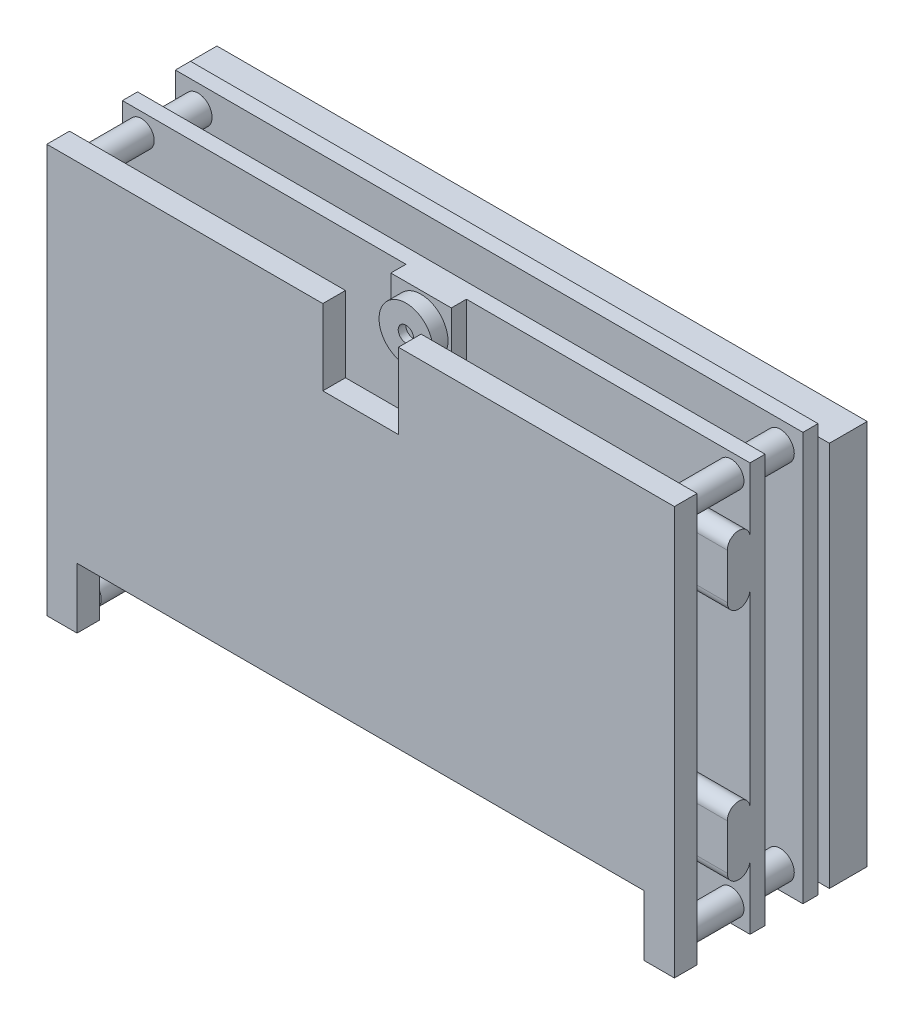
ISO-10303-21;
HEADER;
FILE_DESCRIPTION(('STEP AP214'),'2;1');
FILE_NAME('part.step','',(''),(''),'','','');
FILE_SCHEMA(('AUTOMOTIVE_DESIGN { 1 0 10303 214 1 1 1 1 }'));
ENDSEC;
DATA;
#1=APPLICATION_CONTEXT('core data for automotive mechanical design processes');
#2=APPLICATION_PROTOCOL_DEFINITION('international standard','automotive_design',2000,#1);
#3=PRODUCT_CONTEXT('',#1,'mechanical');
#4=PRODUCT('Part','Part','',(#3));
#5=PRODUCT_RELATED_PRODUCT_CATEGORY('part','',(#4));
#6=PRODUCT_DEFINITION_FORMATION('','',#4);
#7=PRODUCT_DEFINITION_CONTEXT('part definition',#1,'design');
#8=PRODUCT_DEFINITION('design','',#6,#7);
#9=PRODUCT_DEFINITION_SHAPE('','',#8);
#10=(LENGTH_UNIT() NAMED_UNIT(*) SI_UNIT(.MILLI.,.METRE.));
#11=(NAMED_UNIT(*) PLANE_ANGLE_UNIT() SI_UNIT($,.RADIAN.));
#12=(NAMED_UNIT(*) SI_UNIT($,.STERADIAN.) SOLID_ANGLE_UNIT());
#13=UNCERTAINTY_MEASURE_WITH_UNIT(LENGTH_MEASURE(1.E-05),#10,'distance_accuracy_value','');
#14=(GEOMETRIC_REPRESENTATION_CONTEXT(3) GLOBAL_UNCERTAINTY_ASSIGNED_CONTEXT((#13)) GLOBAL_UNIT_ASSIGNED_CONTEXT((#10,
#11,#12)) REPRESENTATION_CONTEXT('',''));
#15=CARTESIAN_POINT('',(0.,0.,0.));
#16=DIRECTION('',(0.,0.,1.));
#17=DIRECTION('',(1.,0.,0.));
#18=AXIS2_PLACEMENT_3D('',#15,#16,#17);
#19=CARTESIAN_POINT('',(0.,0.,-16.));
#20=DIRECTION('',(0.,0.,1.));
#21=DIRECTION('',(1.,0.,0.));
#22=AXIS2_PLACEMENT_3D('',#19,#20,#21);
#23=PLANE('',#22);
#24=DIRECTION('',(-1.,0.,0.));
#25=VECTOR('',#24,1.);
#26=CARTESIAN_POINT('',(43.,-25.5,-16.));
#27=LINE('',#26,#25);
#28=CARTESIAN_POINT('',(41.5,-25.5,-16.));
#29=VERTEX_POINT('',#28);
#30=CARTESIAN_POINT('',(-41.5,-25.5,-16.));
#31=VERTEX_POINT('',#30);
#32=EDGE_CURVE('E11',#29,#31,#27,.T.);
#33=ORIENTED_EDGE('',*,*,#32,.F.);
#34=DIRECTION('',(0.,-1.,0.));
#35=VECTOR('',#34,1.);
#36=CARTESIAN_POINT('',(41.5,-27.,-16.));
#37=LINE('',#36,#35);
#38=CARTESIAN_POINT('',(41.5,-27.,-16.));
#39=VERTEX_POINT('',#38);
#40=EDGE_CURVE('E383',#29,#39,#37,.T.);
#41=ORIENTED_EDGE('',*,*,#40,.T.);
#42=DIRECTION('',(-1.,0.,0.));
#43=VECTOR('',#42,1.);
#44=CARTESIAN_POINT('',(41.5,-27.,-16.));
#45=LINE('',#44,#43);
#46=CARTESIAN_POINT('',(-41.5,-27.,-16.));
#47=VERTEX_POINT('',#46);
#48=EDGE_CURVE('E386',#39,#47,#45,.T.);
#49=ORIENTED_EDGE('',*,*,#48,.T.);
#50=DIRECTION('',(0.,1.,0.));
#51=VECTOR('',#50,1.);
#52=CARTESIAN_POINT('',(-41.5,-27.,-16.));
#53=LINE('',#52,#51);
#54=EDGE_CURVE('E377',#47,#31,#53,.T.);
#55=ORIENTED_EDGE('',*,*,#54,.T.);
#56=EDGE_LOOP('',(#33,#41,#49,#55));
#57=FACE_BOUND('',#56,.T.);
#58=ADVANCED_FACE('F36',(#57),#23,.F.);
#59=DIRECTION('',(1.,0.,0.));
#60=VECTOR('',#59,1.);
#61=CARTESIAN_POINT('',(43.,25.5,-16.));
#62=LINE('',#61,#60);
#63=CARTESIAN_POINT('',(-41.5,25.5,-16.));
#64=VERTEX_POINT('',#63);
#65=CARTESIAN_POINT('',(41.5,25.5,-16.));
#66=VERTEX_POINT('',#65);
#67=EDGE_CURVE('E45',#64,#66,#62,.T.);
#68=ORIENTED_EDGE('',*,*,#67,.F.);
#69=CARTESIAN_POINT('',(-41.5,27.,-16.));
#70=VERTEX_POINT('',#69);
#71=EDGE_CURVE('E381',#64,#70,#53,.T.);
#72=ORIENTED_EDGE('',*,*,#71,.T.);
#73=DIRECTION('',(1.,0.,0.));
#74=VECTOR('',#73,1.);
#75=CARTESIAN_POINT('',(41.5,27.,-16.));
#76=LINE('',#75,#74);
#77=CARTESIAN_POINT('',(41.5,27.,-16.));
#78=VERTEX_POINT('',#77);
#79=EDGE_CURVE('E379',#70,#78,#76,.T.);
#80=ORIENTED_EDGE('',*,*,#79,.T.);
#81=EDGE_CURVE('E384',#78,#66,#37,.T.);
#82=ORIENTED_EDGE('',*,*,#81,.T.);
#83=EDGE_LOOP('',(#68,#72,#80,#82));
#84=FACE_BOUND('',#83,.T.);
#85=ADVANCED_FACE('F777',(#84),#23,.F.);
#86=CARTESIAN_POINT('',(0.,0.,-7.));
#87=DIRECTION('',(0.,0.,1.));
#88=DIRECTION('',(1.,0.,0.));
#89=AXIS2_PLACEMENT_3D('',#86,#87,#88);
#90=PLANE('',#89);
#91=DIRECTION('',(1.,0.,0.));
#92=VECTOR('',#91,1.);
#93=CARTESIAN_POINT('',(0.,-11.,-7.));
#94=LINE('',#93,#92);
#95=CARTESIAN_POINT('',(-41.5,-11.,-7.));
#96=VERTEX_POINT('',#95);
#97=CARTESIAN_POINT('',(-27.5,-11.,-7.));
#98=VERTEX_POINT('',#97);
#99=EDGE_CURVE('E458',#96,#98,#94,.T.);
#100=ORIENTED_EDGE('',*,*,#99,.F.);
#101=DIRECTION('',(0.,1.,0.));
#102=VECTOR('',#101,1.);
#103=CARTESIAN_POINT('',(-41.5,-27.,-7.));
#104=LINE('',#103,#102);
#105=CARTESIAN_POINT('',(-41.5,-27.,-7.));
#106=VERTEX_POINT('',#105);
#107=EDGE_CURVE('E582',#106,#96,#104,.T.);
#108=ORIENTED_EDGE('',*,*,#107,.F.);
#109=DIRECTION('',(-1.,0.,0.));
#110=VECTOR('',#109,1.);
#111=CARTESIAN_POINT('',(41.5,-27.,-7.));
#112=LINE('',#111,#110);
#113=CARTESIAN_POINT('',(41.5,-27.,-7.));
#114=VERTEX_POINT('',#113);
#115=EDGE_CURVE('E593',#114,#106,#112,.T.);
#116=ORIENTED_EDGE('',*,*,#115,.F.);
#117=DIRECTION('',(0.,-1.,0.));
#118=VECTOR('',#117,1.);
#119=CARTESIAN_POINT('',(41.5,-27.,-7.));
#120=LINE('',#119,#118);
#121=CARTESIAN_POINT('',(41.5,-18.5,-7.));
#122=VERTEX_POINT('',#121);
#123=EDGE_CURVE('E589',#122,#114,#120,.T.);
#124=ORIENTED_EDGE('',*,*,#123,.F.);
#125=DIRECTION('',(1.,0.,0.));
#126=VECTOR('',#125,1.);
#127=CARTESIAN_POINT('',(34.5,-18.5,-7.));
#128=LINE('',#127,#126);
#129=CARTESIAN_POINT('',(34.5,-18.5,-7.));
#130=VERTEX_POINT('',#129);
#131=EDGE_CURVE('E471',#130,#122,#128,.T.);
#132=ORIENTED_EDGE('',*,*,#131,.F.);
#133=DIRECTION('',(0.,-1.,0.));
#134=VECTOR('',#133,1.);
#135=CARTESIAN_POINT('',(34.5,-18.5,-7.));
#136=LINE('',#135,#134);
#137=CARTESIAN_POINT('',(34.5,-12.5,-7.));
#138=VERTEX_POINT('',#137);
#139=EDGE_CURVE('E464',#138,#130,#136,.T.);
#140=ORIENTED_EDGE('',*,*,#139,.F.);
#141=DIRECTION('',(1.,0.,0.));
#142=VECTOR('',#141,1.);
#143=CARTESIAN_POINT('',(34.5,-12.5,-7.));
#144=LINE('',#143,#142);
#145=CARTESIAN_POINT('',(41.5,-12.5,-7.));
#146=VERTEX_POINT('',#145);
#147=EDGE_CURVE('E484',#138,#146,#144,.T.);
#148=ORIENTED_EDGE('',*,*,#147,.T.);
#149=CARTESIAN_POINT('',(41.5,12.5,-7.));
#150=VERTEX_POINT('',#149);
#151=EDGE_CURVE('E594',#150,#146,#120,.T.);
#152=ORIENTED_EDGE('',*,*,#151,.F.);
#153=DIRECTION('',(1.,0.,0.));
#154=VECTOR('',#153,1.);
#155=CARTESIAN_POINT('',(34.5,12.5,-7.));
#156=LINE('',#155,#154);
#157=CARTESIAN_POINT('',(34.5,12.5,-7.));
#158=VERTEX_POINT('',#157);
#159=EDGE_CURVE('E512',#158,#150,#156,.T.);
#160=ORIENTED_EDGE('',*,*,#159,.F.);
#161=DIRECTION('',(0.,1.,0.));
#162=VECTOR('',#161,1.);
#163=CARTESIAN_POINT('',(34.5,18.5,-7.));
#164=LINE('',#163,#162);
#165=CARTESIAN_POINT('',(34.5,18.5,-7.));
#166=VERTEX_POINT('',#165);
#167=EDGE_CURVE('E498',#158,#166,#164,.T.);
#168=ORIENTED_EDGE('',*,*,#167,.T.);
#169=DIRECTION('',(1.,0.,0.));
#170=VECTOR('',#169,1.);
#171=CARTESIAN_POINT('',(34.5,18.5,-7.));
#172=LINE('',#171,#170);
#173=CARTESIAN_POINT('',(41.5,18.5,-7.));
#174=VERTEX_POINT('',#173);
#175=EDGE_CURVE('E508',#166,#174,#172,.T.);
#176=ORIENTED_EDGE('',*,*,#175,.T.);
#177=CARTESIAN_POINT('',(41.5,27.,-7.));
#178=VERTEX_POINT('',#177);
#179=EDGE_CURVE('E590',#178,#174,#120,.T.);
#180=ORIENTED_EDGE('',*,*,#179,.F.);
#181=DIRECTION('',(1.,0.,0.));
#182=VECTOR('',#181,1.);
#183=CARTESIAN_POINT('',(41.5,27.,-7.));
#184=LINE('',#183,#182);
#185=CARTESIAN_POINT('',(4.,27.,-7.));
#186=VERTEX_POINT('',#185);
#187=EDGE_CURVE('E585',#186,#178,#184,.T.);
#188=ORIENTED_EDGE('',*,*,#187,.F.);
#189=DIRECTION('',(0.,1.,0.));
#190=VECTOR('',#189,1.);
#191=CARTESIAN_POINT('',(4.,19.,-7.));
#192=LINE('',#191,#190);
#193=CARTESIAN_POINT('',(4.,19.,-7.));
#194=VERTEX_POINT('',#193);
#195=EDGE_CURVE('E540',#194,#186,#192,.T.);
#196=ORIENTED_EDGE('',*,*,#195,.F.);
#197=DIRECTION('',(1.,0.,0.));
#198=VECTOR('',#197,1.);
#199=CARTESIAN_POINT('',(-4.,19.,-7.));
#200=LINE('',#199,#198);
#201=CARTESIAN_POINT('',(-4.,19.,-7.));
#202=VERTEX_POINT('',#201);
#203=EDGE_CURVE('E550',#202,#194,#200,.T.);
#204=ORIENTED_EDGE('',*,*,#203,.F.);
#205=DIRECTION('',(0.,-1.,0.));
#206=VECTOR('',#205,1.);
#207=CARTESIAN_POINT('',(-4.,19.,-7.));
#208=LINE('',#207,#206);
#209=CARTESIAN_POINT('',(-4.,27.,-7.));
#210=VERTEX_POINT('',#209);
#211=EDGE_CURVE('E559',#210,#202,#208,.T.);
#212=ORIENTED_EDGE('',*,*,#211,.F.);
#213=CARTESIAN_POINT('',(-41.5,27.,-7.));
#214=VERTEX_POINT('',#213);
#215=EDGE_CURVE('E586',#214,#210,#184,.T.);
#216=ORIENTED_EDGE('',*,*,#215,.F.);
#217=CARTESIAN_POINT('',(-41.5,5.,-7.));
#218=VERTEX_POINT('',#217);
#219=EDGE_CURVE('E571',#218,#214,#104,.T.);
#220=ORIENTED_EDGE('',*,*,#219,.F.);
#221=DIRECTION('',(-1.,0.,0.));
#222=VECTOR('',#221,1.);
#223=CARTESIAN_POINT('',(0.,5.,-7.));
#224=LINE('',#223,#222);
#225=CARTESIAN_POINT('',(-27.5,5.,-7.));
#226=VERTEX_POINT('',#225);
#227=EDGE_CURVE('E455',#226,#218,#224,.T.);
#228=ORIENTED_EDGE('',*,*,#227,.F.);
#229=DIRECTION('',(0.,-1.,0.));
#230=VECTOR('',#229,1.);
#231=CARTESIAN_POINT('',(-27.5,0.,-7.));
#232=LINE('',#231,#230);
#233=EDGE_CURVE('E445',#226,#98,#232,.T.);
#234=ORIENTED_EDGE('',*,*,#233,.T.);
#235=EDGE_LOOP('',(#100,#108,#116,#124,#132,#140,#148,#152,#160,#168,#176,#180,#188,#196,#204,
#212,#216,#220,#228,#234));
#236=FACE_BOUND('',#235,.T.);
#237=CARTESIAN_POINT('',(39.,24.5,-7.));
#238=DIRECTION('',(0.,0.,-1.));
#239=DIRECTION('',(-1.,0.,0.));
#240=AXIS2_PLACEMENT_3D('',#237,#238,#239);
#241=CIRCLE('',#240,1.7);
#242=CARTESIAN_POINT('',(37.3,24.5,-7.));
#243=VERTEX_POINT('',#242);
#244=EDGE_CURVE('E620',#243,#243,#241,.T.);
#245=ORIENTED_EDGE('',*,*,#244,.T.);
#246=EDGE_LOOP('',(#245));
#247=FACE_BOUND('',#246,.T.);
#248=CARTESIAN_POINT('',(-39.,24.5,-7.));
#249=DIRECTION('',(0.,0.,-1.));
#250=DIRECTION('',(1.,0.,0.));
#251=AXIS2_PLACEMENT_3D('',#248,#249,#250);
#252=CIRCLE('',#251,1.7);
#253=CARTESIAN_POINT('',(-37.3,24.5,-7.));
#254=VERTEX_POINT('',#253);
#255=EDGE_CURVE('E614',#254,#254,#252,.T.);
#256=ORIENTED_EDGE('',*,*,#255,.T.);
#257=EDGE_LOOP('',(#256));
#258=FACE_BOUND('',#257,.T.);
#259=CARTESIAN_POINT('',(-39.,-24.5,-7.));
#260=DIRECTION('',(0.,0.,-1.));
#261=DIRECTION('',(-1.,0.,0.));
#262=AXIS2_PLACEMENT_3D('',#259,#260,#261);
#263=CIRCLE('',#262,1.7);
#264=CARTESIAN_POINT('',(-40.7,-24.5,-7.));
#265=VERTEX_POINT('',#264);
#266=EDGE_CURVE('E610',#265,#265,#263,.T.);
#267=ORIENTED_EDGE('',*,*,#266,.T.);
#268=EDGE_LOOP('',(#267));
#269=FACE_BOUND('',#268,.T.);
#270=CARTESIAN_POINT('',(39.,-24.5,-7.));
#271=DIRECTION('',(0.,0.,-1.));
#272=DIRECTION('',(1.,0.,0.));
#273=AXIS2_PLACEMENT_3D('',#270,#271,#272);
#274=CIRCLE('',#273,1.69999999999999);
#275=CARTESIAN_POINT('',(40.7,-24.5,-7.));
#276=VERTEX_POINT('',#275);
#277=EDGE_CURVE('E607',#276,#276,#274,.T.);
#278=ORIENTED_EDGE('',*,*,#277,.T.);
#279=EDGE_LOOP('',(#278));
#280=FACE_BOUND('',#279,.T.);
#281=ADVANCED_FACE('F799',(#236,#247,#258,#269,#280),#90,.T.);
#282=CARTESIAN_POINT('',(-41.5,-27.,3.));
#283=DIRECTION('',(0.,1.,0.));
#284=DIRECTION('',(0.,0.,1.));
#285=AXIS2_PLACEMENT_3D('',#282,#283,#284);
#286=PLANE('',#285);
#287=DIRECTION('',(0.,0.,-1.));
#288=VECTOR('',#287,1.);
#289=CARTESIAN_POINT('',(37.5,-27.,3.));
#290=LINE('',#289,#288);
#291=CARTESIAN_POINT('',(37.5,-27.,3.));
#292=VERTEX_POINT('',#291);
#293=CARTESIAN_POINT('',(37.5,-27.,0.));
#294=VERTEX_POINT('',#293);
#295=EDGE_CURVE('E521',#292,#294,#290,.T.);
#296=ORIENTED_EDGE('',*,*,#295,.T.);
#297=DIRECTION('',(1.,0.,0.));
#298=VECTOR('',#297,1.);
#299=CARTESIAN_POINT('',(-41.5,-27.,0.));
#300=LINE('',#299,#298);
#301=CARTESIAN_POINT('',(41.5,-27.,0.));
#302=VERTEX_POINT('',#301);
#303=EDGE_CURVE('E692',#294,#302,#300,.T.);
#304=ORIENTED_EDGE('',*,*,#303,.T.);
#305=DIRECTION('',(0.,0.,-1.));
#306=VECTOR('',#305,1.);
#307=CARTESIAN_POINT('',(41.5,-27.,3.));
#308=LINE('',#307,#306);
#309=CARTESIAN_POINT('',(41.5,-27.,3.));
#310=VERTEX_POINT('',#309);
#311=EDGE_CURVE('E681',#310,#302,#308,.T.);
#312=ORIENTED_EDGE('',*,*,#311,.F.);
#313=DIRECTION('',(1.,0.,0.));
#314=VECTOR('',#313,1.);
#315=CARTESIAN_POINT('',(-41.5,-27.,3.));
#316=LINE('',#315,#314);
#317=EDGE_CURVE('E677',#292,#310,#316,.T.);
#318=ORIENTED_EDGE('',*,*,#317,.F.);
#319=EDGE_LOOP('',(#296,#304,#312,#318));
#320=FACE_BOUND('',#319,.T.);
#321=ADVANCED_FACE('F1064',(#320),#286,.F.);
#322=CARTESIAN_POINT('',(0.,0.,3.));
#323=DIRECTION('',(0.,0.,1.));
#324=DIRECTION('',(1.,0.,0.));
#325=AXIS2_PLACEMENT_3D('',#322,#323,#324);
#326=PLANE('',#325);
#327=DIRECTION('',(1.,0.,0.));
#328=VECTOR('',#327,1.);
#329=CARTESIAN_POINT('',(16.5,-19.,3.));
#330=LINE('',#329,#328);
#331=CARTESIAN_POINT('',(-37.5,-19.,3.));
#332=VERTEX_POINT('',#331);
#333=CARTESIAN_POINT('',(37.5,-19.,3.));
#334=VERTEX_POINT('',#333);
#335=EDGE_CURVE('E627',#332,#334,#330,.T.);
#336=ORIENTED_EDGE('',*,*,#335,.T.);
#337=DIRECTION('',(0.,1.,0.));
#338=VECTOR('',#337,1.);
#339=CARTESIAN_POINT('',(37.5,-19.,3.));
#340=LINE('',#339,#338);
#341=EDGE_CURVE('E518',#292,#334,#340,.T.);
#342=ORIENTED_EDGE('',*,*,#341,.F.);
#343=ORIENTED_EDGE('',*,*,#317,.T.);
#344=DIRECTION('',(0.,1.,0.));
#345=VECTOR('',#344,1.);
#346=CARTESIAN_POINT('',(41.5,27.,3.));
#347=LINE('',#346,#345);
#348=CARTESIAN_POINT('',(41.5,27.,3.));
#349=VERTEX_POINT('',#348);
#350=EDGE_CURVE('E667',#310,#349,#347,.T.);
#351=ORIENTED_EDGE('',*,*,#350,.T.);
#352=DIRECTION('',(-1.,0.,0.));
#353=VECTOR('',#352,1.);
#354=CARTESIAN_POINT('',(-41.5,27.,3.));
#355=LINE('',#354,#353);
#356=CARTESIAN_POINT('',(5.,27.,3.));
#357=VERTEX_POINT('',#356);
#358=EDGE_CURVE('E672',#349,#357,#355,.T.);
#359=ORIENTED_EDGE('',*,*,#358,.T.);
#360=DIRECTION('',(0.,-1.,0.));
#361=VECTOR('',#360,1.);
#362=CARTESIAN_POINT('',(5.,17.,3.));
#363=LINE('',#362,#361);
#364=CARTESIAN_POINT('',(5.,17.,3.));
#365=VERTEX_POINT('',#364);
#366=EDGE_CURVE('E644',#357,#365,#363,.T.);
#367=ORIENTED_EDGE('',*,*,#366,.T.);
#368=DIRECTION('',(-1.,0.,0.));
#369=VECTOR('',#368,1.);
#370=CARTESIAN_POINT('',(5.,17.,3.));
#371=LINE('',#370,#369);
#372=CARTESIAN_POINT('',(-5.,17.,3.));
#373=VERTEX_POINT('',#372);
#374=EDGE_CURVE('E648',#365,#373,#371,.T.);
#375=ORIENTED_EDGE('',*,*,#374,.T.);
#376=DIRECTION('',(0.,1.,0.));
#377=VECTOR('',#376,1.);
#378=CARTESIAN_POINT('',(-5.,17.,3.));
#379=LINE('',#378,#377);
#380=CARTESIAN_POINT('',(-5.,27.,3.));
#381=VERTEX_POINT('',#380);
#382=EDGE_CURVE('E641',#373,#381,#379,.T.);
#383=ORIENTED_EDGE('',*,*,#382,.T.);
#384=CARTESIAN_POINT('',(-41.5,27.,3.));
#385=VERTEX_POINT('',#384);
#386=EDGE_CURVE('E670',#381,#385,#355,.T.);
#387=ORIENTED_EDGE('',*,*,#386,.T.);
#388=DIRECTION('',(0.,-1.,0.));
#389=VECTOR('',#388,1.);
#390=CARTESIAN_POINT('',(-41.5,27.,3.));
#391=LINE('',#390,#389);
#392=CARTESIAN_POINT('',(-41.5,-27.,3.));
#393=VERTEX_POINT('',#392);
#394=EDGE_CURVE('E675',#385,#393,#391,.T.);
#395=ORIENTED_EDGE('',*,*,#394,.T.);
#396=CARTESIAN_POINT('',(-37.5,-27.,3.));
#397=VERTEX_POINT('',#396);
#398=EDGE_CURVE('E678',#393,#397,#316,.T.);
#399=ORIENTED_EDGE('',*,*,#398,.T.);
#400=DIRECTION('',(0.,1.,0.));
#401=VECTOR('',#400,1.);
#402=CARTESIAN_POINT('',(-37.5,-19.,3.));
#403=LINE('',#402,#401);
#404=EDGE_CURVE('E624',#397,#332,#403,.T.);
#405=ORIENTED_EDGE('',*,*,#404,.T.);
#406=EDGE_LOOP('',(#336,#342,#343,#351,#359,#367,#375,#383,#387,#395,#399,#405));
#407=FACE_BOUND('',#406,.T.);
#408=ADVANCED_FACE('F1051',(#407),#326,.T.);
#409=CARTESIAN_POINT('',(0.,0.,0.));
#410=DIRECTION('',(0.,0.,1.));
#411=DIRECTION('',(1.,0.,0.));
#412=AXIS2_PLACEMENT_3D('',#409,#410,#411);
#413=PLANE('',#412);
#414=DIRECTION('',(0.,-1.,0.));
#415=VECTOR('',#414,1.);
#416=CARTESIAN_POINT('',(-41.5,27.,0.));
#417=LINE('',#416,#415);
#418=CARTESIAN_POINT('',(-41.5,-11.,0.));
#419=VERTEX_POINT('',#418);
#420=CARTESIAN_POINT('',(-41.5,-27.,0.));
#421=VERTEX_POINT('',#420);
#422=EDGE_CURVE('E688',#419,#421,#417,.T.);
#423=ORIENTED_EDGE('',*,*,#422,.F.);
#424=DIRECTION('',(-1.,0.,0.));
#425=VECTOR('',#424,1.);
#426=CARTESIAN_POINT('',(-27.5,-11.,0.));
#427=LINE('',#426,#425);
#428=CARTESIAN_POINT('',(-27.5,-11.,0.));
#429=VERTEX_POINT('',#428);
#430=EDGE_CURVE('E443',#429,#419,#427,.T.);
#431=ORIENTED_EDGE('',*,*,#430,.F.);
#432=DIRECTION('',(0.,1.,0.));
#433=VECTOR('',#432,1.);
#434=CARTESIAN_POINT('',(-27.5,5.,0.));
#435=LINE('',#434,#433);
#436=CARTESIAN_POINT('',(-27.5,5.,0.));
#437=VERTEX_POINT('',#436);
#438=EDGE_CURVE('E419',#429,#437,#435,.T.);
#439=ORIENTED_EDGE('',*,*,#438,.T.);
#440=DIRECTION('',(-1.,0.,0.));
#441=VECTOR('',#440,1.);
#442=CARTESIAN_POINT('',(-27.5,5.,0.));
#443=LINE('',#442,#441);
#444=CARTESIAN_POINT('',(-41.5,5.,0.));
#445=VERTEX_POINT('',#444);
#446=EDGE_CURVE('E434',#437,#445,#443,.T.);
#447=ORIENTED_EDGE('',*,*,#446,.T.);
#448=CARTESIAN_POINT('',(-41.5,27.,0.));
#449=VERTEX_POINT('',#448);
#450=EDGE_CURVE('E689',#449,#445,#417,.T.);
#451=ORIENTED_EDGE('',*,*,#450,.F.);
#452=DIRECTION('',(-1.,0.,0.));
#453=VECTOR('',#452,1.);
#454=CARTESIAN_POINT('',(-41.5,27.,0.));
#455=LINE('',#454,#453);
#456=CARTESIAN_POINT('',(-5.,27.,0.));
#457=VERTEX_POINT('',#456);
#458=EDGE_CURVE('E684',#457,#449,#455,.T.);
#459=ORIENTED_EDGE('',*,*,#458,.F.);
#460=DIRECTION('',(0.,1.,0.));
#461=VECTOR('',#460,1.);
#462=CARTESIAN_POINT('',(-5.,17.,0.));
#463=LINE('',#462,#461);
#464=CARTESIAN_POINT('',(-5.,17.,0.));
#465=VERTEX_POINT('',#464);
#466=EDGE_CURVE('E638',#465,#457,#463,.T.);
#467=ORIENTED_EDGE('',*,*,#466,.F.);
#468=DIRECTION('',(-1.,0.,0.));
#469=VECTOR('',#468,1.);
#470=CARTESIAN_POINT('',(5.,17.,0.));
#471=LINE('',#470,#469);
#472=CARTESIAN_POINT('',(5.,17.,0.));
#473=VERTEX_POINT('',#472);
#474=EDGE_CURVE('E645',#473,#465,#471,.T.);
#475=ORIENTED_EDGE('',*,*,#474,.F.);
#476=DIRECTION('',(0.,-1.,0.));
#477=VECTOR('',#476,1.);
#478=CARTESIAN_POINT('',(5.,17.,0.));
#479=LINE('',#478,#477);
#480=CARTESIAN_POINT('',(5.,27.,0.));
#481=VERTEX_POINT('',#480);
#482=EDGE_CURVE('E653',#481,#473,#479,.T.);
#483=ORIENTED_EDGE('',*,*,#482,.F.);
#484=CARTESIAN_POINT('',(41.5,27.,0.));
#485=VERTEX_POINT('',#484);
#486=EDGE_CURVE('E685',#485,#481,#455,.T.);
#487=ORIENTED_EDGE('',*,*,#486,.F.);
#488=DIRECTION('',(0.,1.,0.));
#489=VECTOR('',#488,1.);
#490=CARTESIAN_POINT('',(41.5,27.,0.));
#491=LINE('',#490,#489);
#492=EDGE_CURVE('E660',#302,#485,#491,.T.);
#493=ORIENTED_EDGE('',*,*,#492,.F.);
#494=ORIENTED_EDGE('',*,*,#303,.F.);
#495=DIRECTION('',(0.,1.,0.));
#496=VECTOR('',#495,1.);
#497=CARTESIAN_POINT('',(37.5,-19.,0.));
#498=LINE('',#497,#496);
#499=CARTESIAN_POINT('',(37.5,-25.3,0.));
#500=VERTEX_POINT('',#499);
#501=EDGE_CURVE('E522',#294,#500,#498,.T.);
#502=ORIENTED_EDGE('',*,*,#501,.T.);
#503=CARTESIAN_POINT('',(39.,-24.5,0.));
#504=DIRECTION('',(0.,0.,1.));
#505=DIRECTION('',(1.,0.,0.));
#506=AXIS2_PLACEMENT_3D('',#503,#504,#505);
#507=CIRCLE('',#506,1.69999999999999);
#508=CARTESIAN_POINT('',(37.5,-23.7,0.));
#509=VERTEX_POINT('',#508);
#510=EDGE_CURVE('E712',#509,#500,#507,.F.);
#511=ORIENTED_EDGE('',*,*,#510,.F.);
#512=CARTESIAN_POINT('',(37.5,-19.,0.));
#513=VERTEX_POINT('',#512);
#514=EDGE_CURVE('E511',#509,#513,#498,.T.);
#515=ORIENTED_EDGE('',*,*,#514,.T.);
#516=DIRECTION('',(1.,0.,0.));
#517=VECTOR('',#516,1.);
#518=CARTESIAN_POINT('',(16.5,-19.,0.));
#519=LINE('',#518,#517);
#520=CARTESIAN_POINT('',(-37.5,-19.,0.));
#521=VERTEX_POINT('',#520);
#522=EDGE_CURVE('E628',#521,#513,#519,.T.);
#523=ORIENTED_EDGE('',*,*,#522,.F.);
#524=DIRECTION('',(0.,1.,0.));
#525=VECTOR('',#524,1.);
#526=CARTESIAN_POINT('',(-37.5,-19.,0.));
#527=LINE('',#526,#525);
#528=CARTESIAN_POINT('',(-37.5,-23.7,0.));
#529=VERTEX_POINT('',#528);
#530=EDGE_CURVE('E623',#529,#521,#527,.T.);
#531=ORIENTED_EDGE('',*,*,#530,.F.);
#532=CARTESIAN_POINT('',(-39.,-24.5,0.));
#533=DIRECTION('',(0.,0.,-1.));
#534=DIRECTION('',(-1.,0.,0.));
#535=AXIS2_PLACEMENT_3D('',#532,#533,#534);
#536=CIRCLE('',#535,1.7);
#537=CARTESIAN_POINT('',(-37.5,-25.3,0.));
#538=VERTEX_POINT('',#537);
#539=EDGE_CURVE('E615',#538,#529,#536,.T.);
#540=ORIENTED_EDGE('',*,*,#539,.F.);
#541=CARTESIAN_POINT('',(-37.5,-27.,0.));
#542=VERTEX_POINT('',#541);
#543=EDGE_CURVE('E631',#542,#538,#527,.T.);
#544=ORIENTED_EDGE('',*,*,#543,.F.);
#545=EDGE_CURVE('E671',#421,#542,#300,.T.);
#546=ORIENTED_EDGE('',*,*,#545,.F.);
#547=EDGE_LOOP('',(#423,#431,#439,#447,#451,#459,#467,#475,#483,#487,#493,#494,#502,#511,#515,
#523,#531,#540,#544,#546));
#548=FACE_BOUND('',#547,.T.);
#549=CARTESIAN_POINT('',(39.,24.5,0.));
#550=DIRECTION('',(0.,0.,1.));
#551=DIRECTION('',(1.,0.,0.));
#552=AXIS2_PLACEMENT_3D('',#549,#550,#551);
#553=CIRCLE('',#552,1.7);
#554=CARTESIAN_POINT('',(40.7,24.5,0.));
#555=VERTEX_POINT('',#554);
#556=EDGE_CURVE('E706',#555,#555,#553,.F.);
#557=ORIENTED_EDGE('',*,*,#556,.F.);
#558=EDGE_LOOP('',(#557));
#559=FACE_BOUND('',#558,.T.);
#560=CARTESIAN_POINT('',(-39.,24.5,0.));
#561=DIRECTION('',(0.,0.,1.));
#562=DIRECTION('',(1.,0.,0.));
#563=AXIS2_PLACEMENT_3D('',#560,#561,#562);
#564=CIRCLE('',#563,1.7);
#565=CARTESIAN_POINT('',(-37.3,24.5,0.));
#566=VERTEX_POINT('',#565);
#567=EDGE_CURVE('E709',#566,#566,#564,.F.);
#568=ORIENTED_EDGE('',*,*,#567,.F.);
#569=EDGE_LOOP('',(#568));
#570=FACE_BOUND('',#569,.T.);
#571=ADVANCED_FACE('F1045',(#548,#559,#570),#413,.F.);
#572=ORIENTED_EDGE('',*,*,#545,.T.);
#573=DIRECTION('',(0.,0.,-1.));
#574=VECTOR('',#573,1.);
#575=CARTESIAN_POINT('',(-37.5,-27.,3.));
#576=LINE('',#575,#574);
#577=EDGE_CURVE('E636',#397,#542,#576,.T.);
#578=ORIENTED_EDGE('',*,*,#577,.F.);
#579=ORIENTED_EDGE('',*,*,#398,.F.);
#580=DIRECTION('',(0.,0.,-1.));
#581=VECTOR('',#580,1.);
#582=CARTESIAN_POINT('',(-41.5,-27.,3.));
#583=LINE('',#582,#581);
#584=EDGE_CURVE('E697',#393,#421,#583,.T.);
#585=ORIENTED_EDGE('',*,*,#584,.T.);
#586=EDGE_LOOP('',(#572,#578,#579,#585));
#587=FACE_BOUND('',#586,.T.);
#588=ADVANCED_FACE('F1050',(#587),#286,.F.);
#589=CARTESIAN_POINT('',(-41.5,27.,3.));
#590=DIRECTION('',(0.,-1.,0.));
#591=DIRECTION('',(0.,0.,-1.));
#592=AXIS2_PLACEMENT_3D('',#589,#590,#591);
#593=PLANE('',#592);
#594=ORIENTED_EDGE('',*,*,#386,.F.);
#595=DIRECTION('',(0.,0.,-1.));
#596=VECTOR('',#595,1.);
#597=CARTESIAN_POINT('',(-5.,27.,3.));
#598=LINE('',#597,#596);
#599=EDGE_CURVE('E651',#381,#457,#598,.T.);
#600=ORIENTED_EDGE('',*,*,#599,.T.);
#601=ORIENTED_EDGE('',*,*,#458,.T.);
#602=DIRECTION('',(0.,0.,-1.));
#603=VECTOR('',#602,1.);
#604=CARTESIAN_POINT('',(-41.5,27.,3.));
#605=LINE('',#604,#603);
#606=EDGE_CURVE('E700',#385,#449,#605,.T.);
#607=ORIENTED_EDGE('',*,*,#606,.F.);
#608=EDGE_LOOP('',(#594,#600,#601,#607));
#609=FACE_BOUND('',#608,.T.);
#610=ADVANCED_FACE('F1392',(#609),#593,.F.);
#611=CARTESIAN_POINT('',(41.5,27.,3.));
#612=DIRECTION('',(-1.,0.,0.));
#613=DIRECTION('',(0.,0.,1.));
#614=AXIS2_PLACEMENT_3D('',#611,#612,#613);
#615=PLANE('',#614);
#616=ORIENTED_EDGE('',*,*,#492,.T.);
#617=DIRECTION('',(0.,0.,-1.));
#618=VECTOR('',#617,1.);
#619=CARTESIAN_POINT('',(41.5,27.,3.));
#620=LINE('',#619,#618);
#621=EDGE_CURVE('E703',#349,#485,#620,.T.);
#622=ORIENTED_EDGE('',*,*,#621,.F.);
#623=ORIENTED_EDGE('',*,*,#350,.F.);
#624=ORIENTED_EDGE('',*,*,#311,.T.);
#625=EDGE_LOOP('',(#616,#622,#623,#624));
#626=FACE_BOUND('',#625,.T.);
#627=ADVANCED_FACE('F38',(#626),#615,.F.);
#628=ORIENTED_EDGE('',*,*,#486,.T.);
#629=DIRECTION('',(0.,0.,-1.));
#630=VECTOR('',#629,1.);
#631=CARTESIAN_POINT('',(5.,27.,3.));
#632=LINE('',#631,#630);
#633=EDGE_CURVE('E663',#357,#481,#632,.T.);
#634=ORIENTED_EDGE('',*,*,#633,.F.);
#635=ORIENTED_EDGE('',*,*,#358,.F.);
#636=ORIENTED_EDGE('',*,*,#621,.T.);
#637=EDGE_LOOP('',(#628,#634,#635,#636));
#638=FACE_BOUND('',#637,.T.);
#639=ADVANCED_FACE('F1036',(#638),#593,.F.);
#640=CARTESIAN_POINT('',(-41.5,27.,3.));
#641=DIRECTION('',(1.,0.,0.));
#642=DIRECTION('',(0.,0.,-1.));
#643=AXIS2_PLACEMENT_3D('',#640,#641,#642);
#644=PLANE('',#643);
#645=ORIENTED_EDGE('',*,*,#450,.T.);
#646=DIRECTION('',(0.,0.,-1.));
#647=VECTOR('',#646,1.);
#648=CARTESIAN_POINT('',(-41.5,5.,-11.));
#649=LINE('',#648,#647);
#650=EDGE_CURVE('E435',#445,#218,#649,.T.);
#651=ORIENTED_EDGE('',*,*,#650,.T.);
#652=ORIENTED_EDGE('',*,*,#219,.T.);
#653=DIRECTION('',(0.,0.,1.));
#654=VECTOR('',#653,1.);
#655=CARTESIAN_POINT('',(-41.5,27.,-9.));
#656=LINE('',#655,#654);
#657=CARTESIAN_POINT('',(-41.5,27.,-9.));
#658=VERTEX_POINT('',#657);
#659=EDGE_CURVE('E604',#658,#214,#656,.T.);
#660=ORIENTED_EDGE('',*,*,#659,.F.);
#661=DIRECTION('',(0.,1.,0.));
#662=VECTOR('',#661,1.);
#663=CARTESIAN_POINT('',(-41.5,-27.,-9.));
#664=LINE('',#663,#662);
#665=CARTESIAN_POINT('',(-41.5,5.,-9.));
#666=VERTEX_POINT('',#665);
#667=EDGE_CURVE('E575',#666,#658,#664,.T.);
#668=ORIENTED_EDGE('',*,*,#667,.F.);
#669=CARTESIAN_POINT('',(-41.5,5.,-11.));
#670=VERTEX_POINT('',#669);
#671=EDGE_CURVE('E418',#666,#670,#649,.T.);
#672=ORIENTED_EDGE('',*,*,#671,.T.);
#673=DIRECTION('',(0.,-1.,0.));
#674=VECTOR('',#673,1.);
#675=CARTESIAN_POINT('',(-41.5,5.,-11.));
#676=LINE('',#675,#674);
#677=CARTESIAN_POINT('',(-41.5,-11.,-11.));
#678=VERTEX_POINT('',#677);
#679=EDGE_CURVE('E437',#670,#678,#676,.T.);
#680=ORIENTED_EDGE('',*,*,#679,.T.);
#681=DIRECTION('',(0.,0.,1.));
#682=VECTOR('',#681,1.);
#683=CARTESIAN_POINT('',(-41.5,-11.,-11.));
#684=LINE('',#683,#682);
#685=CARTESIAN_POINT('',(-41.5,-11.,-9.));
#686=VERTEX_POINT('',#685);
#687=EDGE_CURVE('E423',#678,#686,#684,.T.);
#688=ORIENTED_EDGE('',*,*,#687,.T.);
#689=CARTESIAN_POINT('',(-41.5,-27.,-9.));
#690=VERTEX_POINT('',#689);
#691=EDGE_CURVE('E572',#690,#686,#664,.T.);
#692=ORIENTED_EDGE('',*,*,#691,.F.);
#693=DIRECTION('',(0.,0.,1.));
#694=VECTOR('',#693,1.);
#695=CARTESIAN_POINT('',(-41.5,-27.,-9.));
#696=LINE('',#695,#694);
#697=EDGE_CURVE('E581',#690,#106,#696,.T.);
#698=ORIENTED_EDGE('',*,*,#697,.T.);
#699=ORIENTED_EDGE('',*,*,#107,.T.);
#700=EDGE_CURVE('E440',#96,#419,#684,.T.);
#701=ORIENTED_EDGE('',*,*,#700,.T.);
#702=ORIENTED_EDGE('',*,*,#422,.T.);
#703=ORIENTED_EDGE('',*,*,#584,.F.);
#704=ORIENTED_EDGE('',*,*,#394,.F.);
#705=ORIENTED_EDGE('',*,*,#606,.T.);
#706=EDGE_LOOP('',(#645,#651,#652,#660,#668,#672,#680,#688,#692,#698,#699,#701,#702,#703,#704,#705));
#707=FACE_BOUND('',#706,.T.);
#708=ADVANCED_FACE('F1031',(#707),#644,.F.);
#709=CARTESIAN_POINT('',(-5.,17.,3.));
#710=DIRECTION('',(-1.,0.,0.));
#711=DIRECTION('',(0.,0.,1.));
#712=AXIS2_PLACEMENT_3D('',#709,#710,#711);
#713=PLANE('',#712);
#714=ORIENTED_EDGE('',*,*,#466,.T.);
#715=ORIENTED_EDGE('',*,*,#599,.F.);
#716=ORIENTED_EDGE('',*,*,#382,.F.);
#717=DIRECTION('',(0.,0.,-1.));
#718=VECTOR('',#717,1.);
#719=CARTESIAN_POINT('',(-5.,17.,3.));
#720=LINE('',#719,#718);
#721=EDGE_CURVE('E658',#373,#465,#720,.T.);
#722=ORIENTED_EDGE('',*,*,#721,.T.);
#723=EDGE_LOOP('',(#714,#715,#716,#722));
#724=FACE_BOUND('',#723,.T.);
#725=ADVANCED_FACE('F1035',(#724),#713,.F.);
#726=CARTESIAN_POINT('',(5.,17.,3.));
#727=DIRECTION('',(0.,-1.,0.));
#728=DIRECTION('',(0.,0.,-1.));
#729=AXIS2_PLACEMENT_3D('',#726,#727,#728);
#730=PLANE('',#729);
#731=ORIENTED_EDGE('',*,*,#474,.T.);
#732=ORIENTED_EDGE('',*,*,#721,.F.);
#733=ORIENTED_EDGE('',*,*,#374,.F.);
#734=DIRECTION('',(0.,0.,-1.));
#735=VECTOR('',#734,1.);
#736=CARTESIAN_POINT('',(5.,17.,3.));
#737=LINE('',#736,#735);
#738=EDGE_CURVE('E661',#365,#473,#737,.T.);
#739=ORIENTED_EDGE('',*,*,#738,.T.);
#740=EDGE_LOOP('',(#731,#732,#733,#739));
#741=FACE_BOUND('',#740,.T.);
#742=ADVANCED_FACE('F1401',(#741),#730,.F.);
#743=CARTESIAN_POINT('',(5.,17.,3.));
#744=DIRECTION('',(1.,0.,0.));
#745=DIRECTION('',(0.,0.,-1.));
#746=AXIS2_PLACEMENT_3D('',#743,#744,#745);
#747=PLANE('',#746);
#748=ORIENTED_EDGE('',*,*,#482,.T.);
#749=ORIENTED_EDGE('',*,*,#738,.F.);
#750=ORIENTED_EDGE('',*,*,#366,.F.);
#751=ORIENTED_EDGE('',*,*,#633,.T.);
#752=EDGE_LOOP('',(#748,#749,#750,#751));
#753=FACE_BOUND('',#752,.T.);
#754=ADVANCED_FACE('F1380',(#753),#747,.F.);
#755=CARTESIAN_POINT('',(-37.5,-19.,3.));
#756=DIRECTION('',(-1.,0.,0.));
#757=DIRECTION('',(0.,0.,1.));
#758=AXIS2_PLACEMENT_3D('',#755,#756,#757);
#759=PLANE('',#758);
#760=ORIENTED_EDGE('',*,*,#543,.T.);
#761=EDGE_CURVE('E634',#538,#529,#527,.T.);
#762=ORIENTED_EDGE('',*,*,#761,.T.);
#763=ORIENTED_EDGE('',*,*,#530,.T.);
#764=DIRECTION('',(0.,0.,-1.));
#765=VECTOR('',#764,1.);
#766=CARTESIAN_POINT('',(-37.5,-19.,3.));
#767=LINE('',#766,#765);
#768=EDGE_CURVE('E630',#332,#521,#767,.T.);
#769=ORIENTED_EDGE('',*,*,#768,.F.);
#770=ORIENTED_EDGE('',*,*,#404,.F.);
#771=ORIENTED_EDGE('',*,*,#577,.T.);
#772=EDGE_LOOP('',(#760,#762,#763,#769,#770,#771));
#773=FACE_BOUND('',#772,.T.);
#774=ADVANCED_FACE('F1215',(#773),#759,.F.);
#775=CARTESIAN_POINT('',(16.5,-19.,3.));
#776=DIRECTION('',(0.,1.,0.));
#777=DIRECTION('',(-1.,0.,0.));
#778=AXIS2_PLACEMENT_3D('',#775,#776,#777);
#779=PLANE('',#778);
#780=DIRECTION('',(0.,0.,-1.));
#781=VECTOR('',#780,1.);
#782=CARTESIAN_POINT('',(37.5,-19.,3.));
#783=LINE('',#782,#781);
#784=EDGE_CURVE('E526',#334,#513,#783,.T.);
#785=ORIENTED_EDGE('',*,*,#784,.F.);
#786=ORIENTED_EDGE('',*,*,#335,.F.);
#787=ORIENTED_EDGE('',*,*,#768,.T.);
#788=ORIENTED_EDGE('',*,*,#522,.T.);
#789=EDGE_LOOP('',(#785,#786,#787,#788));
#790=FACE_BOUND('',#789,.T.);
#791=ADVANCED_FACE('F1210',(#790),#779,.F.);
#792=CARTESIAN_POINT('',(39.,24.5,-7.));
#793=DIRECTION('',(0.,0.,1.));
#794=DIRECTION('',(1.,0.,0.));
#795=AXIS2_PLACEMENT_3D('',#792,#793,#794);
#796=CYLINDRICAL_SURFACE('',#795,1.7);
#797=ORIENTED_EDGE('',*,*,#244,.F.);
#798=EDGE_LOOP('',(#797));
#799=FACE_BOUND('',#798,.T.);
#800=ORIENTED_EDGE('',*,*,#556,.T.);
#801=EDGE_LOOP('',(#800));
#802=FACE_BOUND('',#801,.T.);
#803=ADVANCED_FACE('F1214',(#799,#802),#796,.T.);
#804=CARTESIAN_POINT('',(-39.,24.5,-7.));
#805=DIRECTION('',(0.,0.,1.));
#806=DIRECTION('',(1.,0.,0.));
#807=AXIS2_PLACEMENT_3D('',#804,#805,#806);
#808=CYLINDRICAL_SURFACE('',#807,1.7);
#809=ORIENTED_EDGE('',*,*,#255,.F.);
#810=EDGE_LOOP('',(#809));
#811=FACE_BOUND('',#810,.T.);
#812=ORIENTED_EDGE('',*,*,#567,.T.);
#813=EDGE_LOOP('',(#812));
#814=FACE_BOUND('',#813,.T.);
#815=ADVANCED_FACE('F1351',(#811,#814),#808,.T.);
#816=CARTESIAN_POINT('',(-39.,-24.5,0.));
#817=DIRECTION('',(0.,0.,-1.));
#818=DIRECTION('',(-1.,0.,0.));
#819=AXIS2_PLACEMENT_3D('',#816,#817,#818);
#820=PLANE('',#819);
#821=EDGE_CURVE('E611',#529,#538,#536,.T.);
#822=ORIENTED_EDGE('',*,*,#821,.F.);
#823=ORIENTED_EDGE('',*,*,#761,.F.);
#824=EDGE_LOOP('',(#822,#823));
#825=FACE_BOUND('',#824,.T.);
#826=ADVANCED_FACE('F1340',(#825),#820,.F.);
#827=CARTESIAN_POINT('',(-39.,-24.5,-7.));
#828=DIRECTION('',(0.,0.,1.));
#829=DIRECTION('',(1.,0.,0.));
#830=AXIS2_PLACEMENT_3D('',#827,#828,#829);
#831=CYLINDRICAL_SURFACE('',#830,1.7);
#832=ORIENTED_EDGE('',*,*,#266,.F.);
#833=EDGE_LOOP('',(#832));
#834=FACE_BOUND('',#833,.T.);
#835=ORIENTED_EDGE('',*,*,#821,.T.);
#836=ORIENTED_EDGE('',*,*,#539,.T.);
#837=EDGE_LOOP('',(#835,#836));
#838=FACE_BOUND('',#837,.T.);
#839=ADVANCED_FACE('F1200',(#834,#838),#831,.T.);
#840=CARTESIAN_POINT('',(39.,-24.5,-7.));
#841=DIRECTION('',(0.,0.,1.));
#842=DIRECTION('',(1.,0.,0.));
#843=AXIS2_PLACEMENT_3D('',#840,#841,#842);
#844=CYLINDRICAL_SURFACE('',#843,1.69999999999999);
#845=ORIENTED_EDGE('',*,*,#277,.F.);
#846=EDGE_LOOP('',(#845));
#847=FACE_BOUND('',#846,.T.);
#848=EDGE_CURVE('E545',#500,#509,#507,.F.);
#849=ORIENTED_EDGE('',*,*,#848,.T.);
#850=ORIENTED_EDGE('',*,*,#510,.T.);
#851=EDGE_LOOP('',(#849,#850));
#852=FACE_BOUND('',#851,.T.);
#853=ADVANCED_FACE('F1195',(#847,#852),#844,.T.);
#854=CARTESIAN_POINT('',(41.5,27.,-9.));
#855=DIRECTION('',(0.,-1.,0.));
#856=DIRECTION('',(0.,0.,-1.));
#857=AXIS2_PLACEMENT_3D('',#854,#855,#856);
#858=PLANE('',#857);
#859=ORIENTED_EDGE('',*,*,#215,.T.);
#860=DIRECTION('',(0.,0.,-1.));
#861=VECTOR('',#860,1.);
#862=CARTESIAN_POINT('',(-4.,27.,-5.));
#863=LINE('',#862,#861);
#864=CARTESIAN_POINT('',(-4.,27.,-5.));
#865=VERTEX_POINT('',#864);
#866=EDGE_CURVE('E567',#865,#210,#863,.T.);
#867=ORIENTED_EDGE('',*,*,#866,.F.);
#868=DIRECTION('',(-1.,0.,0.));
#869=VECTOR('',#868,1.);
#870=CARTESIAN_POINT('',(-4.,27.,-5.));
#871=LINE('',#870,#869);
#872=CARTESIAN_POINT('',(4.,27.,-5.));
#873=VERTEX_POINT('',#872);
#874=EDGE_CURVE('E549',#873,#865,#871,.T.);
#875=ORIENTED_EDGE('',*,*,#874,.F.);
#876=DIRECTION('',(0.,0.,-1.));
#877=VECTOR('',#876,1.);
#878=CARTESIAN_POINT('',(4.,27.,-5.));
#879=LINE('',#878,#877);
#880=EDGE_CURVE('E569',#873,#186,#879,.T.);
#881=ORIENTED_EDGE('',*,*,#880,.T.);
#882=ORIENTED_EDGE('',*,*,#187,.T.);
#883=DIRECTION('',(0.,0.,1.));
#884=VECTOR('',#883,1.);
#885=CARTESIAN_POINT('',(41.5,27.,-9.));
#886=LINE('',#885,#884);
#887=CARTESIAN_POINT('',(41.5,27.,-9.));
#888=VERTEX_POINT('',#887);
#889=EDGE_CURVE('E601',#888,#178,#886,.T.);
#890=ORIENTED_EDGE('',*,*,#889,.F.);
#891=DIRECTION('',(1.,0.,0.));
#892=VECTOR('',#891,1.);
#893=CARTESIAN_POINT('',(41.5,27.,-9.));
#894=LINE('',#893,#892);
#895=EDGE_CURVE('E574',#658,#888,#894,.T.);
#896=ORIENTED_EDGE('',*,*,#895,.F.);
#897=ORIENTED_EDGE('',*,*,#659,.T.);
#898=EDGE_LOOP('',(#859,#867,#875,#881,#882,#890,#896,#897));
#899=FACE_BOUND('',#898,.T.);
#900=ADVANCED_FACE('F1121',(#899),#858,.F.);
#901=CARTESIAN_POINT('',(41.5,-27.,-9.));
#902=DIRECTION('',(-1.,0.,0.));
#903=DIRECTION('',(0.,0.,1.));
#904=AXIS2_PLACEMENT_3D('',#901,#902,#903);
#905=PLANE('',#904);
#906=ORIENTED_EDGE('',*,*,#179,.T.);
#907=CARTESIAN_POINT('',(41.5,18.5,-5.5));
#908=DIRECTION('',(1.,0.,0.));
#909=DIRECTION('',(0.,0.,-1.));
#910=AXIS2_PLACEMENT_3D('',#907,#908,#909);
#911=CIRCLE('',#910,1.5);
#912=CARTESIAN_POINT('',(41.5,18.5,-4.));
#913=VERTEX_POINT('',#912);
#914=EDGE_CURVE('E480',#174,#913,#911,.T.);
#915=ORIENTED_EDGE('',*,*,#914,.T.);
#916=DIRECTION('',(0.,-1.,0.));
#917=VECTOR('',#916,1.);
#918=CARTESIAN_POINT('',(41.5,18.5,-4.));
#919=LINE('',#918,#917);
#920=CARTESIAN_POINT('',(41.5,12.5,-4.));
#921=VERTEX_POINT('',#920);
#922=EDGE_CURVE('E504',#913,#921,#919,.T.);
#923=ORIENTED_EDGE('',*,*,#922,.T.);
#924=CARTESIAN_POINT('',(41.5,12.5,-5.5));
#925=DIRECTION('',(1.,0.,0.));
#926=DIRECTION('',(0.,0.,-1.));
#927=AXIS2_PLACEMENT_3D('',#924,#925,#926);
#928=CIRCLE('',#927,1.5);
#929=EDGE_CURVE('E493',#921,#150,#928,.T.);
#930=ORIENTED_EDGE('',*,*,#929,.T.);
#931=ORIENTED_EDGE('',*,*,#151,.T.);
#932=CARTESIAN_POINT('',(41.5,-12.5,-5.5));
#933=DIRECTION('',(-1.,0.,0.));
#934=DIRECTION('',(0.,0.,-1.));
#935=AXIS2_PLACEMENT_3D('',#932,#933,#934);
#936=CIRCLE('',#935,1.5);
#937=CARTESIAN_POINT('',(41.5,-12.5,-4.));
#938=VERTEX_POINT('',#937);
#939=EDGE_CURVE('E474',#938,#146,#936,.T.);
#940=ORIENTED_EDGE('',*,*,#939,.F.);
#941=DIRECTION('',(0.,1.,0.));
#942=VECTOR('',#941,1.);
#943=CARTESIAN_POINT('',(41.5,-18.5,-4.));
#944=LINE('',#943,#942);
#945=CARTESIAN_POINT('',(41.5,-18.5,-4.));
#946=VERTEX_POINT('',#945);
#947=EDGE_CURVE('E465',#946,#938,#944,.T.);
#948=ORIENTED_EDGE('',*,*,#947,.F.);
#949=CARTESIAN_POINT('',(41.5,-18.5,-5.5));
#950=DIRECTION('',(-1.,0.,0.));
#951=DIRECTION('',(0.,0.,-1.));
#952=AXIS2_PLACEMENT_3D('',#949,#950,#951);
#953=CIRCLE('',#952,1.5);
#954=EDGE_CURVE('E460',#122,#946,#953,.T.);
#955=ORIENTED_EDGE('',*,*,#954,.F.);
#956=ORIENTED_EDGE('',*,*,#123,.T.);
#957=DIRECTION('',(0.,0.,1.));
#958=VECTOR('',#957,1.);
#959=CARTESIAN_POINT('',(41.5,-27.,-9.));
#960=LINE('',#959,#958);
#961=CARTESIAN_POINT('',(41.5,-27.,-9.));
#962=VERTEX_POINT('',#961);
#963=EDGE_CURVE('E598',#962,#114,#960,.T.);
#964=ORIENTED_EDGE('',*,*,#963,.F.);
#965=DIRECTION('',(0.,-1.,0.));
#966=VECTOR('',#965,1.);
#967=CARTESIAN_POINT('',(41.5,-27.,-9.));
#968=LINE('',#967,#966);
#969=EDGE_CURVE('E577',#888,#962,#968,.T.);
#970=ORIENTED_EDGE('',*,*,#969,.F.);
#971=ORIENTED_EDGE('',*,*,#889,.T.);
#972=EDGE_LOOP('',(#906,#915,#923,#930,#931,#940,#948,#955,#956,#964,#970,#971));
#973=FACE_BOUND('',#972,.T.);
#974=ADVANCED_FACE('F1117',(#973),#905,.F.);
#975=CARTESIAN_POINT('',(41.5,-27.,-9.));
#976=DIRECTION('',(0.,1.,0.));
#977=DIRECTION('',(0.,0.,1.));
#978=AXIS2_PLACEMENT_3D('',#975,#976,#977);
#979=PLANE('',#978);
#980=ORIENTED_EDGE('',*,*,#115,.T.);
#981=ORIENTED_EDGE('',*,*,#697,.F.);
#982=DIRECTION('',(-1.,0.,0.));
#983=VECTOR('',#982,1.);
#984=CARTESIAN_POINT('',(41.5,-27.,-9.));
#985=LINE('',#984,#983);
#986=EDGE_CURVE('E579',#962,#690,#985,.T.);
#987=ORIENTED_EDGE('',*,*,#986,.F.);
#988=ORIENTED_EDGE('',*,*,#963,.T.);
#989=EDGE_LOOP('',(#980,#981,#987,#988));
#990=FACE_BOUND('',#989,.T.);
#991=ADVANCED_FACE('F946',(#990),#979,.F.);
#992=CARTESIAN_POINT('',(0.,0.,-9.));
#993=DIRECTION('',(0.,0.,1.));
#994=DIRECTION('',(1.,0.,0.));
#995=AXIS2_PLACEMENT_3D('',#992,#993,#994);
#996=PLANE('',#995);
#997=CARTESIAN_POINT('',(38.5,-24.,-9.));
#998=DIRECTION('',(0.,0.,1.));
#999=DIRECTION('',(1.,0.,0.));
#1000=AXIS2_PLACEMENT_3D('',#997,#998,#999);
#1001=CIRCLE('',#1000,1.8574304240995);
#1002=CARTESIAN_POINT('',(40.3574304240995,-24.,-9.));
#1003=VERTEX_POINT('',#1002);
#1004=EDGE_CURVE('E40',#1003,#1003,#1001,.F.);
#1005=ORIENTED_EDGE('',*,*,#1004,.F.);
#1006=EDGE_LOOP('',(#1005));
#1007=FACE_BOUND('',#1006,.T.);
#1008=CARTESIAN_POINT('',(-38.5,-24.,-9.));
#1009=DIRECTION('',(0.,0.,1.));
#1010=DIRECTION('',(1.,0.,0.));
#1011=AXIS2_PLACEMENT_3D('',#1008,#1009,#1010);
#1012=CIRCLE('',#1011,1.85743042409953);
#1013=CARTESIAN_POINT('',(-36.6425695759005,-24.,-9.));
#1014=VERTEX_POINT('',#1013);
#1015=EDGE_CURVE('E727',#1014,#1014,#1012,.F.);
#1016=ORIENTED_EDGE('',*,*,#1015,.F.);
#1017=EDGE_LOOP('',(#1016));
#1018=FACE_BOUND('',#1017,.T.);
#1019=CARTESIAN_POINT('',(-38.5,24.,-9.));
#1020=DIRECTION('',(0.,0.,1.));
#1021=DIRECTION('',(1.,0.,0.));
#1022=AXIS2_PLACEMENT_3D('',#1019,#1020,#1021);
#1023=CIRCLE('',#1022,1.85743042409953);
#1024=CARTESIAN_POINT('',(-36.6425695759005,24.,-9.));
#1025=VERTEX_POINT('',#1024);
#1026=EDGE_CURVE('E725',#1025,#1025,#1023,.F.);
#1027=ORIENTED_EDGE('',*,*,#1026,.F.);
#1028=EDGE_LOOP('',(#1027));
#1029=FACE_BOUND('',#1028,.T.);
#1030=CARTESIAN_POINT('',(38.5,24.,-9.));
#1031=DIRECTION('',(0.,0.,1.));
#1032=DIRECTION('',(1.,0.,0.));
#1033=AXIS2_PLACEMENT_3D('',#1030,#1031,#1032);
#1034=CIRCLE('',#1033,1.8574304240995);
#1035=CARTESIAN_POINT('',(40.3574304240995,24.,-9.));
#1036=VERTEX_POINT('',#1035);
#1037=EDGE_CURVE('E722',#1036,#1036,#1034,.F.);
#1038=ORIENTED_EDGE('',*,*,#1037,.F.);
#1039=EDGE_LOOP('',(#1038));
#1040=FACE_BOUND('',#1039,.T.);
#1041=ORIENTED_EDGE('',*,*,#691,.T.);
#1042=DIRECTION('',(1.,0.,0.));
#1043=VECTOR('',#1042,1.);
#1044=CARTESIAN_POINT('',(0.,-11.,-9.));
#1045=LINE('',#1044,#1043);
#1046=CARTESIAN_POINT('',(-27.5,-11.,-9.));
#1047=VERTEX_POINT('',#1046);
#1048=EDGE_CURVE('E720',#686,#1047,#1045,.T.);
#1049=ORIENTED_EDGE('',*,*,#1048,.T.);
#1050=DIRECTION('',(0.,-1.,0.));
#1051=VECTOR('',#1050,1.);
#1052=CARTESIAN_POINT('',(-27.5,0.,-9.));
#1053=LINE('',#1052,#1051);
#1054=CARTESIAN_POINT('',(-27.5,5.,-9.));
#1055=VERTEX_POINT('',#1054);
#1056=EDGE_CURVE('E544',#1055,#1047,#1053,.T.);
#1057=ORIENTED_EDGE('',*,*,#1056,.F.);
#1058=DIRECTION('',(-1.,0.,0.));
#1059=VECTOR('',#1058,1.);
#1060=CARTESIAN_POINT('',(0.,5.,-9.));
#1061=LINE('',#1060,#1059);
#1062=EDGE_CURVE('E717',#1055,#666,#1061,.T.);
#1063=ORIENTED_EDGE('',*,*,#1062,.T.);
#1064=ORIENTED_EDGE('',*,*,#667,.T.);
#1065=ORIENTED_EDGE('',*,*,#895,.T.);
#1066=ORIENTED_EDGE('',*,*,#969,.T.);
#1067=ORIENTED_EDGE('',*,*,#986,.T.);
#1068=EDGE_LOOP('',(#1041,#1049,#1057,#1063,#1064,#1065,#1066,#1067));
#1069=FACE_BOUND('',#1068,.T.);
#1070=ADVANCED_FACE('F940',(#1007,#1018,#1029,#1040,#1069),#996,.F.);
#1071=CARTESIAN_POINT('',(4.,19.,-5.));
#1072=DIRECTION('',(-1.,0.,0.));
#1073=DIRECTION('',(0.,0.,1.));
#1074=AXIS2_PLACEMENT_3D('',#1071,#1072,#1073);
#1075=PLANE('',#1074);
#1076=ORIENTED_EDGE('',*,*,#195,.T.);
#1077=ORIENTED_EDGE('',*,*,#880,.F.);
#1078=DIRECTION('',(0.,1.,0.));
#1079=VECTOR('',#1078,1.);
#1080=CARTESIAN_POINT('',(4.,19.,-5.));
#1081=LINE('',#1080,#1079);
#1082=CARTESIAN_POINT('',(4.,19.,-5.));
#1083=VERTEX_POINT('',#1082);
#1084=EDGE_CURVE('E546',#1083,#873,#1081,.T.);
#1085=ORIENTED_EDGE('',*,*,#1084,.F.);
#1086=DIRECTION('',(0.,0.,-1.));
#1087=VECTOR('',#1086,1.);
#1088=CARTESIAN_POINT('',(4.,19.,-5.));
#1089=LINE('',#1088,#1087);
#1090=EDGE_CURVE('E556',#1083,#194,#1089,.T.);
#1091=ORIENTED_EDGE('',*,*,#1090,.T.);
#1092=EDGE_LOOP('',(#1076,#1077,#1085,#1091));
#1093=FACE_BOUND('',#1092,.T.);
#1094=ADVANCED_FACE('F945',(#1093),#1075,.F.);
#1095=CARTESIAN_POINT('',(-4.,19.,-5.));
#1096=DIRECTION('',(1.,0.,0.));
#1097=DIRECTION('',(0.,0.,-1.));
#1098=AXIS2_PLACEMENT_3D('',#1095,#1096,#1097);
#1099=PLANE('',#1098);
#1100=ORIENTED_EDGE('',*,*,#211,.T.);
#1101=DIRECTION('',(0.,0.,-1.));
#1102=VECTOR('',#1101,1.);
#1103=CARTESIAN_POINT('',(-4.,19.,-5.));
#1104=LINE('',#1103,#1102);
#1105=CARTESIAN_POINT('',(-4.,19.,-5.));
#1106=VERTEX_POINT('',#1105);
#1107=EDGE_CURVE('E565',#1106,#202,#1104,.T.);
#1108=ORIENTED_EDGE('',*,*,#1107,.F.);
#1109=DIRECTION('',(0.,-1.,0.));
#1110=VECTOR('',#1109,1.);
#1111=CARTESIAN_POINT('',(-4.,19.,-5.));
#1112=LINE('',#1111,#1110);
#1113=EDGE_CURVE('E552',#865,#1106,#1112,.T.);
#1114=ORIENTED_EDGE('',*,*,#1113,.F.);
#1115=ORIENTED_EDGE('',*,*,#866,.T.);
#1116=EDGE_LOOP('',(#1100,#1108,#1114,#1115));
#1117=FACE_BOUND('',#1116,.T.);
#1118=ADVANCED_FACE('F1296',(#1117),#1099,.F.);
#1119=CARTESIAN_POINT('',(-4.,19.,-5.));
#1120=DIRECTION('',(0.,1.,0.));
#1121=DIRECTION('',(0.,0.,1.));
#1122=AXIS2_PLACEMENT_3D('',#1119,#1120,#1121);
#1123=PLANE('',#1122);
#1124=ORIENTED_EDGE('',*,*,#203,.T.);
#1125=ORIENTED_EDGE('',*,*,#1090,.F.);
#1126=DIRECTION('',(1.,0.,0.));
#1127=VECTOR('',#1126,1.);
#1128=CARTESIAN_POINT('',(-4.,19.,-5.));
#1129=LINE('',#1128,#1127);
#1130=EDGE_CURVE('E554',#1106,#1083,#1129,.T.);
#1131=ORIENTED_EDGE('',*,*,#1130,.F.);
#1132=ORIENTED_EDGE('',*,*,#1107,.T.);
#1133=EDGE_LOOP('',(#1124,#1125,#1131,#1132));
#1134=FACE_BOUND('',#1133,.T.);
#1135=ADVANCED_FACE('F1285',(#1134),#1123,.F.);
#1136=CARTESIAN_POINT('',(0.,0.,-5.));
#1137=DIRECTION('',(0.,0.,-1.));
#1138=DIRECTION('',(-1.,0.,0.));
#1139=AXIS2_PLACEMENT_3D('',#1136,#1137,#1138);
#1140=PLANE('',#1139);
#1141=CARTESIAN_POINT('',(0.,23.,-5.));
#1142=DIRECTION('',(0.,0.,1.));
#1143=DIRECTION('',(1.,0.,0.));
#1144=AXIS2_PLACEMENT_3D('',#1141,#1142,#1143);
#1145=CIRCLE('',#1144,3.55937895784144);
#1146=CARTESIAN_POINT('',(3.55937895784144,23.,-5.));
#1147=VERTEX_POINT('',#1146);
#1148=EDGE_CURVE('E541',#1147,#1147,#1145,.T.);
#1149=ORIENTED_EDGE('',*,*,#1148,.F.);
#1150=EDGE_LOOP('',(#1149));
#1151=FACE_BOUND('',#1150,.T.);
#1152=ORIENTED_EDGE('',*,*,#1084,.T.);
#1153=ORIENTED_EDGE('',*,*,#874,.T.);
#1154=ORIENTED_EDGE('',*,*,#1113,.T.);
#1155=ORIENTED_EDGE('',*,*,#1130,.T.);
#1156=EDGE_LOOP('',(#1152,#1153,#1154,#1155));
#1157=FACE_BOUND('',#1156,.T.);
#1158=ADVANCED_FACE('F1274',(#1151,#1157),#1140,.F.);
#1159=CARTESIAN_POINT('',(0.,23.,-3.));
#1160=DIRECTION('',(0.,0.,-1.));
#1161=DIRECTION('',(-1.,0.,0.));
#1162=AXIS2_PLACEMENT_3D('',#1159,#1160,#1161);
#1163=CYLINDRICAL_SURFACE('',#1162,3.55937895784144);
#1164=CARTESIAN_POINT('',(0.,23.,-3.));
#1165=DIRECTION('',(0.,0.,1.));
#1166=DIRECTION('',(1.,0.,0.));
#1167=AXIS2_PLACEMENT_3D('',#1164,#1165,#1166);
#1168=CIRCLE('',#1167,3.55937895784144);
#1169=CARTESIAN_POINT('',(3.55937895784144,23.,-3.));
#1170=VERTEX_POINT('',#1169);
#1171=EDGE_CURVE('E535',#1170,#1170,#1168,.T.);
#1172=ORIENTED_EDGE('',*,*,#1171,.F.);
#1173=EDGE_LOOP('',(#1172));
#1174=FACE_BOUND('',#1173,.T.);
#1175=ORIENTED_EDGE('',*,*,#1148,.T.);
#1176=EDGE_LOOP('',(#1175));
#1177=FACE_BOUND('',#1176,.T.);
#1178=ADVANCED_FACE('F1263',(#1174,#1177),#1163,.T.);
#1179=CARTESIAN_POINT('',(0.,23.,-3.));
#1180=DIRECTION('',(0.,0.,1.));
#1181=DIRECTION('',(1.,0.,0.));
#1182=AXIS2_PLACEMENT_3D('',#1179,#1180,#1181);
#1183=PLANE('',#1182);
#1184=CARTESIAN_POINT('',(0.,23.,-3.));
#1185=DIRECTION('',(0.,0.,1.));
#1186=DIRECTION('',(1.,0.,0.));
#1187=AXIS2_PLACEMENT_3D('',#1184,#1185,#1186);
#1188=CIRCLE('',#1187,1.02290572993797);
#1189=CARTESIAN_POINT('',(1.02290572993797,23.,-3.));
#1190=VERTEX_POINT('',#1189);
#1191=EDGE_CURVE('E529',#1190,#1190,#1188,.T.);
#1192=ORIENTED_EDGE('',*,*,#1191,.F.);
#1193=EDGE_LOOP('',(#1192));
#1194=FACE_BOUND('',#1193,.T.);
#1195=ORIENTED_EDGE('',*,*,#1171,.T.);
#1196=EDGE_LOOP('',(#1195));
#1197=FACE_BOUND('',#1196,.T.);
#1198=ADVANCED_FACE('F1252',(#1194,#1197),#1183,.T.);
#1199=CARTESIAN_POINT('',(0.,23.,-4.));
#1200=DIRECTION('',(0.,0.,1.));
#1201=DIRECTION('',(1.,0.,0.));
#1202=AXIS2_PLACEMENT_3D('',#1199,#1200,#1201);
#1203=CYLINDRICAL_SURFACE('',#1202,1.02290572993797);
#1204=CARTESIAN_POINT('',(0.,23.,-4.));
#1205=DIRECTION('',(0.,0.,1.));
#1206=DIRECTION('',(1.,0.,0.));
#1207=AXIS2_PLACEMENT_3D('',#1204,#1205,#1206);
#1208=CIRCLE('',#1207,1.02290572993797);
#1209=CARTESIAN_POINT('',(1.02290572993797,23.,-4.));
#1210=VERTEX_POINT('',#1209);
#1211=EDGE_CURVE('E532',#1210,#1210,#1208,.T.);
#1212=ORIENTED_EDGE('',*,*,#1211,.F.);
#1213=EDGE_LOOP('',(#1212));
#1214=FACE_BOUND('',#1213,.T.);
#1215=ORIENTED_EDGE('',*,*,#1191,.T.);
#1216=EDGE_LOOP('',(#1215));
#1217=FACE_BOUND('',#1216,.T.);
#1218=ADVANCED_FACE('F1242',(#1214,#1217),#1203,.F.);
#1219=CARTESIAN_POINT('',(0.,23.,-4.));
#1220=DIRECTION('',(0.,0.,1.));
#1221=DIRECTION('',(1.,0.,0.));
#1222=AXIS2_PLACEMENT_3D('',#1219,#1220,#1221);
#1223=PLANE('',#1222);
#1224=ORIENTED_EDGE('',*,*,#1211,.T.);
#1225=EDGE_LOOP('',(#1224));
#1226=FACE_BOUND('',#1225,.T.);
#1227=ADVANCED_FACE('F1186',(#1226),#1223,.T.);
#1228=CARTESIAN_POINT('',(0.,0.,0.));
#1229=DIRECTION('',(0.,0.,-1.));
#1230=DIRECTION('',(1.,0.,0.));
#1231=AXIS2_PLACEMENT_3D('',#1228,#1229,#1230);
#1232=PLANE('',#1231);
#1233=EDGE_CURVE('E525',#500,#509,#498,.T.);
#1234=ORIENTED_EDGE('',*,*,#1233,.T.);
#1235=ORIENTED_EDGE('',*,*,#848,.F.);
#1236=EDGE_LOOP('',(#1234,#1235));
#1237=FACE_BOUND('',#1236,.T.);
#1238=ADVANCED_FACE('F1175',(#1237),#1232,.F.);
#1239=CARTESIAN_POINT('',(37.5,-19.,3.));
#1240=DIRECTION('',(-1.,0.,0.));
#1241=DIRECTION('',(0.,0.,1.));
#1242=AXIS2_PLACEMENT_3D('',#1239,#1240,#1241);
#1243=PLANE('',#1242);
#1244=ORIENTED_EDGE('',*,*,#501,.F.);
#1245=ORIENTED_EDGE('',*,*,#295,.F.);
#1246=ORIENTED_EDGE('',*,*,#341,.T.);
#1247=ORIENTED_EDGE('',*,*,#784,.T.);
#1248=ORIENTED_EDGE('',*,*,#514,.F.);
#1249=ORIENTED_EDGE('',*,*,#1233,.F.);
#1250=EDGE_LOOP('',(#1244,#1245,#1246,#1247,#1248,#1249));
#1251=FACE_BOUND('',#1250,.T.);
#1252=ADVANCED_FACE('F1164',(#1251),#1243,.T.);
#1253=CARTESIAN_POINT('',(34.5,18.5,-5.5));
#1254=DIRECTION('',(1.,0.,0.));
#1255=DIRECTION('',(0.,0.,-1.));
#1256=AXIS2_PLACEMENT_3D('',#1253,#1254,#1255);
#1257=CYLINDRICAL_SURFACE('',#1256,1.5);
#1258=ORIENTED_EDGE('',*,*,#914,.F.);
#1259=ORIENTED_EDGE('',*,*,#175,.F.);
#1260=CARTESIAN_POINT('',(34.5,18.5,-5.5));
#1261=DIRECTION('',(1.,0.,0.));
#1262=DIRECTION('',(0.,0.,-1.));
#1263=AXIS2_PLACEMENT_3D('',#1260,#1261,#1262);
#1264=CIRCLE('',#1263,1.5);
#1265=CARTESIAN_POINT('',(34.5,18.5,-4.));
#1266=VERTEX_POINT('',#1265);
#1267=EDGE_CURVE('E489',#166,#1266,#1264,.T.);
#1268=ORIENTED_EDGE('',*,*,#1267,.T.);
#1269=DIRECTION('',(1.,0.,0.));
#1270=VECTOR('',#1269,1.);
#1271=CARTESIAN_POINT('',(34.5,18.5,-4.));
#1272=LINE('',#1271,#1270);
#1273=EDGE_CURVE('E501',#1266,#913,#1272,.T.);
#1274=ORIENTED_EDGE('',*,*,#1273,.T.);
#1275=EDGE_LOOP('',(#1258,#1259,#1268,#1274));
#1276=FACE_BOUND('',#1275,.T.);
#1277=ADVANCED_FACE('F1153',(#1276),#1257,.T.);
#1278=CARTESIAN_POINT('',(34.5,12.5,-5.5));
#1279=DIRECTION('',(1.,0.,0.));
#1280=DIRECTION('',(0.,0.,-1.));
#1281=AXIS2_PLACEMENT_3D('',#1278,#1279,#1280);
#1282=CYLINDRICAL_SURFACE('',#1281,1.5);
#1283=ORIENTED_EDGE('',*,*,#929,.F.);
#1284=DIRECTION('',(1.,0.,0.));
#1285=VECTOR('',#1284,1.);
#1286=CARTESIAN_POINT('',(34.5,12.5,-4.));
#1287=LINE('',#1286,#1285);
#1288=CARTESIAN_POINT('',(34.5,12.5,-4.));
#1289=VERTEX_POINT('',#1288);
#1290=EDGE_CURVE('E515',#1289,#921,#1287,.T.);
#1291=ORIENTED_EDGE('',*,*,#1290,.F.);
#1292=CARTESIAN_POINT('',(34.5,12.5,-5.5));
#1293=DIRECTION('',(1.,0.,0.));
#1294=DIRECTION('',(0.,0.,-1.));
#1295=AXIS2_PLACEMENT_3D('',#1292,#1293,#1294);
#1296=CIRCLE('',#1295,1.5);
#1297=EDGE_CURVE('E496',#1289,#158,#1296,.T.);
#1298=ORIENTED_EDGE('',*,*,#1297,.T.);
#1299=ORIENTED_EDGE('',*,*,#159,.T.);
#1300=EDGE_LOOP('',(#1283,#1291,#1298,#1299));
#1301=FACE_BOUND('',#1300,.T.);
#1302=ADVANCED_FACE('F1142',(#1301),#1282,.T.);
#1303=CARTESIAN_POINT('',(34.5,18.5,-4.));
#1304=DIRECTION('',(0.,0.,1.));
#1305=DIRECTION('',(0.,-1.,0.));
#1306=AXIS2_PLACEMENT_3D('',#1303,#1304,#1305);
#1307=PLANE('',#1306);
#1308=ORIENTED_EDGE('',*,*,#922,.F.);
#1309=ORIENTED_EDGE('',*,*,#1273,.F.);
#1310=DIRECTION('',(0.,-1.,0.));
#1311=VECTOR('',#1310,1.);
#1312=CARTESIAN_POINT('',(34.5,18.5,-4.));
#1313=LINE('',#1312,#1311);
#1314=EDGE_CURVE('E492',#1266,#1289,#1313,.T.);
#1315=ORIENTED_EDGE('',*,*,#1314,.T.);
#1316=ORIENTED_EDGE('',*,*,#1290,.T.);
#1317=EDGE_LOOP('',(#1308,#1309,#1315,#1316));
#1318=FACE_BOUND('',#1317,.T.);
#1319=ADVANCED_FACE('F1132',(#1318),#1307,.T.);
#1320=CARTESIAN_POINT('',(34.5,18.5,-5.5));
#1321=DIRECTION('',(1.,0.,0.));
#1322=DIRECTION('',(0.,0.,-1.));
#1323=AXIS2_PLACEMENT_3D('',#1320,#1321,#1322);
#1324=PLANE('',#1323);
#1325=ORIENTED_EDGE('',*,*,#1267,.F.);
#1326=ORIENTED_EDGE('',*,*,#167,.F.);
#1327=ORIENTED_EDGE('',*,*,#1297,.F.);
#1328=ORIENTED_EDGE('',*,*,#1314,.F.);
#1329=EDGE_LOOP('',(#1325,#1326,#1327,#1328));
#1330=FACE_BOUND('',#1329,.T.);
#1331=ADVANCED_FACE('F1109',(#1330),#1324,.F.);
#1332=CARTESIAN_POINT('',(34.5,-18.5,-5.5));
#1333=DIRECTION('',(1.,0.,0.));
#1334=DIRECTION('',(0.,0.,-1.));
#1335=AXIS2_PLACEMENT_3D('',#1332,#1333,#1334);
#1336=CYLINDRICAL_SURFACE('',#1335,1.5);
#1337=ORIENTED_EDGE('',*,*,#954,.T.);
#1338=DIRECTION('',(1.,0.,0.));
#1339=VECTOR('',#1338,1.);
#1340=CARTESIAN_POINT('',(34.5,-18.5,-4.));
#1341=LINE('',#1340,#1339);
#1342=CARTESIAN_POINT('',(34.5,-18.5,-4.));
#1343=VERTEX_POINT('',#1342);
#1344=EDGE_CURVE('E477',#1343,#946,#1341,.T.);
#1345=ORIENTED_EDGE('',*,*,#1344,.F.);
#1346=CARTESIAN_POINT('',(34.5,-18.5,-5.5));
#1347=DIRECTION('',(-1.,0.,0.));
#1348=DIRECTION('',(0.,0.,-1.));
#1349=AXIS2_PLACEMENT_3D('',#1346,#1347,#1348);
#1350=CIRCLE('',#1349,1.5);
#1351=EDGE_CURVE('E461',#130,#1343,#1350,.T.);
#1352=ORIENTED_EDGE('',*,*,#1351,.F.);
#1353=ORIENTED_EDGE('',*,*,#131,.T.);
#1354=EDGE_LOOP('',(#1337,#1345,#1352,#1353));
#1355=FACE_BOUND('',#1354,.T.);
#1356=ADVANCED_FACE('F1098',(#1355),#1336,.T.);
#1357=CARTESIAN_POINT('',(34.5,-18.5,-4.));
#1358=DIRECTION('',(0.,0.,-1.));
#1359=DIRECTION('',(0.,1.,0.));
#1360=AXIS2_PLACEMENT_3D('',#1357,#1358,#1359);
#1361=PLANE('',#1360);
#1362=ORIENTED_EDGE('',*,*,#947,.T.);
#1363=DIRECTION('',(1.,0.,0.));
#1364=VECTOR('',#1363,1.);
#1365=CARTESIAN_POINT('',(34.5,-12.5,-4.));
#1366=LINE('',#1365,#1364);
#1367=CARTESIAN_POINT('',(34.5,-12.5,-4.));
#1368=VERTEX_POINT('',#1367);
#1369=EDGE_CURVE('E481',#1368,#938,#1366,.T.);
#1370=ORIENTED_EDGE('',*,*,#1369,.F.);
#1371=DIRECTION('',(0.,1.,0.));
#1372=VECTOR('',#1371,1.);
#1373=CARTESIAN_POINT('',(34.5,-18.5,-4.));
#1374=LINE('',#1373,#1372);
#1375=EDGE_CURVE('E469',#1343,#1368,#1374,.T.);
#1376=ORIENTED_EDGE('',*,*,#1375,.F.);
#1377=ORIENTED_EDGE('',*,*,#1344,.T.);
#1378=EDGE_LOOP('',(#1362,#1370,#1376,#1377));
#1379=FACE_BOUND('',#1378,.T.);
#1380=ADVANCED_FACE('F1087',(#1379),#1361,.F.);
#1381=CARTESIAN_POINT('',(34.5,-12.5,-5.5));
#1382=DIRECTION('',(1.,0.,0.));
#1383=DIRECTION('',(0.,0.,-1.));
#1384=AXIS2_PLACEMENT_3D('',#1381,#1382,#1383);
#1385=CYLINDRICAL_SURFACE('',#1384,1.5);
#1386=ORIENTED_EDGE('',*,*,#939,.T.);
#1387=ORIENTED_EDGE('',*,*,#147,.F.);
#1388=CARTESIAN_POINT('',(34.5,-12.5,-5.5));
#1389=DIRECTION('',(-1.,0.,0.));
#1390=DIRECTION('',(0.,0.,-1.));
#1391=AXIS2_PLACEMENT_3D('',#1388,#1389,#1390);
#1392=CIRCLE('',#1391,1.5);
#1393=EDGE_CURVE('E467',#1368,#138,#1392,.T.);
#1394=ORIENTED_EDGE('',*,*,#1393,.F.);
#1395=ORIENTED_EDGE('',*,*,#1369,.T.);
#1396=EDGE_LOOP('',(#1386,#1387,#1394,#1395));
#1397=FACE_BOUND('',#1396,.T.);
#1398=ADVANCED_FACE('F1076',(#1397),#1385,.T.);
#1399=CARTESIAN_POINT('',(34.5,-18.5,-5.5));
#1400=DIRECTION('',(1.,0.,0.));
#1401=DIRECTION('',(0.,0.,-1.));
#1402=AXIS2_PLACEMENT_3D('',#1399,#1400,#1401);
#1403=PLANE('',#1402);
#1404=ORIENTED_EDGE('',*,*,#1351,.T.);
#1405=ORIENTED_EDGE('',*,*,#1375,.T.);
#1406=ORIENTED_EDGE('',*,*,#1393,.T.);
#1407=ORIENTED_EDGE('',*,*,#139,.T.);
#1408=EDGE_LOOP('',(#1404,#1405,#1406,#1407));
#1409=FACE_BOUND('',#1408,.T.);
#1410=ADVANCED_FACE('F1022',(#1409),#1403,.F.);
#1411=CARTESIAN_POINT('',(-27.5,5.,-11.));
#1412=DIRECTION('',(0.,0.,-1.));
#1413=DIRECTION('',(0.,1.,0.));
#1414=AXIS2_PLACEMENT_3D('',#1411,#1412,#1413);
#1415=PLANE('',#1414);
#1416=ORIENTED_EDGE('',*,*,#679,.F.);
#1417=DIRECTION('',(-1.,0.,0.));
#1418=VECTOR('',#1417,1.);
#1419=CARTESIAN_POINT('',(-27.5,5.,-11.));
#1420=LINE('',#1419,#1418);
#1421=CARTESIAN_POINT('',(-27.5,5.,-11.));
#1422=VERTEX_POINT('',#1421);
#1423=EDGE_CURVE('E448',#1422,#670,#1420,.T.);
#1424=ORIENTED_EDGE('',*,*,#1423,.F.);
#1425=DIRECTION('',(0.,-1.,0.));
#1426=VECTOR('',#1425,1.);
#1427=CARTESIAN_POINT('',(-27.5,5.,-11.));
#1428=LINE('',#1427,#1426);
#1429=CARTESIAN_POINT('',(-27.5,-11.,-11.));
#1430=VERTEX_POINT('',#1429);
#1431=EDGE_CURVE('E427',#1422,#1430,#1428,.T.);
#1432=ORIENTED_EDGE('',*,*,#1431,.T.);
#1433=DIRECTION('',(-1.,0.,0.));
#1434=VECTOR('',#1433,1.);
#1435=CARTESIAN_POINT('',(-27.5,-11.,-11.));
#1436=LINE('',#1435,#1434);
#1437=EDGE_CURVE('E446',#1430,#678,#1436,.T.);
#1438=ORIENTED_EDGE('',*,*,#1437,.T.);
#1439=EDGE_LOOP('',(#1416,#1424,#1432,#1438));
#1440=FACE_BOUND('',#1439,.T.);
#1441=ADVANCED_FACE('F1012',(#1440),#1415,.T.);
#1442=CARTESIAN_POINT('',(-27.5,0.,0.));
#1443=DIRECTION('',(-1.,0.,0.));
#1444=DIRECTION('',(0.,0.,1.));
#1445=AXIS2_PLACEMENT_3D('',#1442,#1443,#1444);
#1446=PLANE('',#1445);
#1447=DIRECTION('',(0.,0.,-1.));
#1448=VECTOR('',#1447,1.);
#1449=CARTESIAN_POINT('',(-27.5,5.,-11.));
#1450=LINE('',#1449,#1448);
#1451=EDGE_CURVE('E422',#1055,#1422,#1450,.T.);
#1452=ORIENTED_EDGE('',*,*,#1451,.F.);
#1453=ORIENTED_EDGE('',*,*,#1056,.T.);
#1454=DIRECTION('',(0.,0.,1.));
#1455=VECTOR('',#1454,1.);
#1456=CARTESIAN_POINT('',(-27.5,-11.,-11.));
#1457=LINE('',#1456,#1455);
#1458=EDGE_CURVE('E431',#1430,#1047,#1457,.T.);
#1459=ORIENTED_EDGE('',*,*,#1458,.F.);
#1460=ORIENTED_EDGE('',*,*,#1431,.F.);
#1461=EDGE_LOOP('',(#1452,#1453,#1459,#1460));
#1462=FACE_BOUND('',#1461,.T.);
#1463=ADVANCED_FACE('F962',(#1462),#1446,.F.);
#1464=CARTESIAN_POINT('',(-27.5,5.,-11.));
#1465=DIRECTION('',(0.,1.,0.));
#1466=DIRECTION('',(0.,0.,1.));
#1467=AXIS2_PLACEMENT_3D('',#1464,#1465,#1466);
#1468=PLANE('',#1467);
#1469=ORIENTED_EDGE('',*,*,#1062,.F.);
#1470=ORIENTED_EDGE('',*,*,#1451,.T.);
#1471=ORIENTED_EDGE('',*,*,#1423,.T.);
#1472=ORIENTED_EDGE('',*,*,#671,.F.);
#1473=EDGE_LOOP('',(#1469,#1470,#1471,#1472));
#1474=FACE_BOUND('',#1473,.T.);
#1475=ADVANCED_FACE('F974',(#1474),#1468,.T.);
#1476=CARTESIAN_POINT('',(-27.5,-11.,-11.));
#1477=DIRECTION('',(0.,-1.,0.));
#1478=DIRECTION('',(0.,0.,-1.));
#1479=AXIS2_PLACEMENT_3D('',#1476,#1477,#1478);
#1480=PLANE('',#1479);
#1481=ORIENTED_EDGE('',*,*,#1048,.F.);
#1482=ORIENTED_EDGE('',*,*,#687,.F.);
#1483=ORIENTED_EDGE('',*,*,#1437,.F.);
#1484=ORIENTED_EDGE('',*,*,#1458,.T.);
#1485=EDGE_LOOP('',(#1481,#1482,#1483,#1484));
#1486=FACE_BOUND('',#1485,.T.);
#1487=ADVANCED_FACE('F983',(#1486),#1480,.T.);
#1488=ORIENTED_EDGE('',*,*,#700,.F.);
#1489=ORIENTED_EDGE('',*,*,#99,.T.);
#1490=EDGE_CURVE('E430',#98,#429,#1457,.T.);
#1491=ORIENTED_EDGE('',*,*,#1490,.T.);
#1492=ORIENTED_EDGE('',*,*,#430,.T.);
#1493=EDGE_LOOP('',(#1488,#1489,#1491,#1492));
#1494=FACE_BOUND('',#1493,.T.);
#1495=ADVANCED_FACE('F971',(#1494),#1480,.T.);
#1496=EDGE_CURVE('E424',#437,#226,#1450,.T.);
#1497=ORIENTED_EDGE('',*,*,#1496,.T.);
#1498=ORIENTED_EDGE('',*,*,#227,.T.);
#1499=ORIENTED_EDGE('',*,*,#650,.F.);
#1500=ORIENTED_EDGE('',*,*,#446,.F.);
#1501=EDGE_LOOP('',(#1497,#1498,#1499,#1500));
#1502=FACE_BOUND('',#1501,.T.);
#1503=ADVANCED_FACE('F959',(#1502),#1468,.T.);
#1504=ORIENTED_EDGE('',*,*,#233,.F.);
#1505=ORIENTED_EDGE('',*,*,#1496,.F.);
#1506=ORIENTED_EDGE('',*,*,#438,.F.);
#1507=ORIENTED_EDGE('',*,*,#1490,.F.);
#1508=EDGE_LOOP('',(#1504,#1505,#1506,#1507));
#1509=FACE_BOUND('',#1508,.T.);
#1510=ADVANCED_FACE('F931',(#1509),#1446,.F.);
#1511=CARTESIAN_POINT('',(38.5,24.,-14.));
#1512=DIRECTION('',(0.,0.,1.));
#1513=DIRECTION('',(1.,0.,0.));
#1514=AXIS2_PLACEMENT_3D('',#1511,#1512,#1513);
#1515=CYLINDRICAL_SURFACE('',#1514,1.8574304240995);
#1516=CARTESIAN_POINT('',(38.5,24.,-14.));
#1517=DIRECTION('',(0.,0.,-1.));
#1518=DIRECTION('',(-1.,0.,0.));
#1519=AXIS2_PLACEMENT_3D('',#1516,#1517,#1518);
#1520=CIRCLE('',#1519,1.8574304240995);
#1521=CARTESIAN_POINT('',(36.6425695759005,24.,-14.));
#1522=VERTEX_POINT('',#1521);
#1523=EDGE_CURVE('E415',#1522,#1522,#1520,.T.);
#1524=ORIENTED_EDGE('',*,*,#1523,.F.);
#1525=EDGE_LOOP('',(#1524));
#1526=FACE_BOUND('',#1525,.T.);
#1527=ORIENTED_EDGE('',*,*,#1037,.T.);
#1528=EDGE_LOOP('',(#1527));
#1529=FACE_BOUND('',#1528,.T.);
#1530=ADVANCED_FACE('F920',(#1526,#1529),#1515,.T.);
#1531=CARTESIAN_POINT('',(-38.5,24.,-14.));
#1532=DIRECTION('',(0.,0.,1.));
#1533=DIRECTION('',(1.,0.,0.));
#1534=AXIS2_PLACEMENT_3D('',#1531,#1532,#1533);
#1535=CYLINDRICAL_SURFACE('',#1534,1.85743042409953);
#1536=CARTESIAN_POINT('',(-38.5,24.,-14.));
#1537=DIRECTION('',(0.,0.,-1.));
#1538=DIRECTION('',(1.,0.,0.));
#1539=AXIS2_PLACEMENT_3D('',#1536,#1537,#1538);
#1540=CIRCLE('',#1539,1.85743042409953);
#1541=CARTESIAN_POINT('',(-36.6425695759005,24.,-14.));
#1542=VERTEX_POINT('',#1541);
#1543=EDGE_CURVE('E412',#1542,#1542,#1540,.T.);
#1544=ORIENTED_EDGE('',*,*,#1543,.F.);
#1545=EDGE_LOOP('',(#1544));
#1546=FACE_BOUND('',#1545,.T.);
#1547=ORIENTED_EDGE('',*,*,#1026,.T.);
#1548=EDGE_LOOP('',(#1547));
#1549=FACE_BOUND('',#1548,.T.);
#1550=ADVANCED_FACE('F909',(#1546,#1549),#1535,.T.);
#1551=CARTESIAN_POINT('',(-38.5,-24.,-14.));
#1552=DIRECTION('',(0.,0.,1.));
#1553=DIRECTION('',(1.,0.,0.));
#1554=AXIS2_PLACEMENT_3D('',#1551,#1552,#1553);
#1555=CYLINDRICAL_SURFACE('',#1554,1.85743042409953);
#1556=CARTESIAN_POINT('',(-38.5,-24.,-14.));
#1557=DIRECTION('',(0.,0.,-1.));
#1558=DIRECTION('',(-1.,0.,0.));
#1559=AXIS2_PLACEMENT_3D('',#1556,#1557,#1558);
#1560=CIRCLE('',#1559,1.85743042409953);
#1561=CARTESIAN_POINT('',(-40.3574304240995,-24.,-14.));
#1562=VERTEX_POINT('',#1561);
#1563=EDGE_CURVE('E409',#1562,#1562,#1560,.T.);
#1564=ORIENTED_EDGE('',*,*,#1563,.F.);
#1565=EDGE_LOOP('',(#1564));
#1566=FACE_BOUND('',#1565,.T.);
#1567=ORIENTED_EDGE('',*,*,#1015,.T.);
#1568=EDGE_LOOP('',(#1567));
#1569=FACE_BOUND('',#1568,.T.);
#1570=ADVANCED_FACE('F898',(#1566,#1569),#1555,.T.);
#1571=CARTESIAN_POINT('',(38.5,-24.,-14.));
#1572=DIRECTION('',(0.,0.,1.));
#1573=DIRECTION('',(1.,0.,0.));
#1574=AXIS2_PLACEMENT_3D('',#1571,#1572,#1573);
#1575=CYLINDRICAL_SURFACE('',#1574,1.8574304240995);
#1576=CARTESIAN_POINT('',(38.5,-24.,-14.));
#1577=DIRECTION('',(0.,0.,-1.));
#1578=DIRECTION('',(1.,0.,0.));
#1579=AXIS2_PLACEMENT_3D('',#1576,#1577,#1578);
#1580=CIRCLE('',#1579,1.8574304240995);
#1581=CARTESIAN_POINT('',(40.3574304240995,-24.,-14.));
#1582=VERTEX_POINT('',#1581);
#1583=EDGE_CURVE('E406',#1582,#1582,#1580,.T.);
#1584=ORIENTED_EDGE('',*,*,#1583,.F.);
#1585=EDGE_LOOP('',(#1584));
#1586=FACE_BOUND('',#1585,.T.);
#1587=ORIENTED_EDGE('',*,*,#1004,.T.);
#1588=EDGE_LOOP('',(#1587));
#1589=FACE_BOUND('',#1588,.T.);
#1590=ADVANCED_FACE('F860',(#1586,#1589),#1575,.T.);
#1591=CARTESIAN_POINT('',(-41.5,-27.,-16.));
#1592=DIRECTION('',(1.,0.,0.));
#1593=DIRECTION('',(0.,0.,-1.));
#1594=AXIS2_PLACEMENT_3D('',#1591,#1592,#1593);
#1595=PLANE('',#1594);
#1596=DIRECTION('',(0.,1.,0.));
#1597=VECTOR('',#1596,1.);
#1598=CARTESIAN_POINT('',(-41.5,-27.,-14.));
#1599=LINE('',#1598,#1597);
#1600=CARTESIAN_POINT('',(-41.5,-27.,-14.));
#1601=VERTEX_POINT('',#1600);
#1602=CARTESIAN_POINT('',(-41.5,27.,-14.));
#1603=VERTEX_POINT('',#1602);
#1604=EDGE_CURVE('E368',#1601,#1603,#1599,.T.);
#1605=ORIENTED_EDGE('',*,*,#1604,.T.);
#1606=DIRECTION('',(0.,0.,1.));
#1607=VECTOR('',#1606,1.);
#1608=CARTESIAN_POINT('',(-41.5,27.,-16.));
#1609=LINE('',#1608,#1607);
#1610=EDGE_CURVE('E403',#70,#1603,#1609,.T.);
#1611=ORIENTED_EDGE('',*,*,#1610,.F.);
#1612=ORIENTED_EDGE('',*,*,#71,.F.);
#1613=EDGE_CURVE('E380',#31,#64,#53,.T.);
#1614=ORIENTED_EDGE('',*,*,#1613,.F.);
#1615=ORIENTED_EDGE('',*,*,#54,.F.);
#1616=DIRECTION('',(0.,0.,1.));
#1617=VECTOR('',#1616,1.);
#1618=CARTESIAN_POINT('',(-41.5,-27.,-16.));
#1619=LINE('',#1618,#1617);
#1620=EDGE_CURVE('E388',#47,#1601,#1619,.T.);
#1621=ORIENTED_EDGE('',*,*,#1620,.T.);
#1622=EDGE_LOOP('',(#1605,#1611,#1612,#1614,#1615,#1621));
#1623=FACE_BOUND('',#1622,.T.);
#1624=ADVANCED_FACE('F772',(#1623),#1595,.F.);
#1625=CARTESIAN_POINT('',(41.5,27.,-16.));
#1626=DIRECTION('',(0.,-1.,0.));
#1627=DIRECTION('',(0.,0.,-1.));
#1628=AXIS2_PLACEMENT_3D('',#1625,#1626,#1627);
#1629=PLANE('',#1628);
#1630=DIRECTION('',(1.,0.,0.));
#1631=VECTOR('',#1630,1.);
#1632=CARTESIAN_POINT('',(41.5,27.,-14.));
#1633=LINE('',#1632,#1631);
#1634=CARTESIAN_POINT('',(41.5,27.,-14.));
#1635=VERTEX_POINT('',#1634);
#1636=EDGE_CURVE('E371',#1603,#1635,#1633,.T.);
#1637=ORIENTED_EDGE('',*,*,#1636,.T.);
#1638=DIRECTION('',(0.,0.,1.));
#1639=VECTOR('',#1638,1.);
#1640=CARTESIAN_POINT('',(41.5,27.,-16.));
#1641=LINE('',#1640,#1639);
#1642=EDGE_CURVE('E400',#78,#1635,#1641,.T.);
#1643=ORIENTED_EDGE('',*,*,#1642,.F.);
#1644=ORIENTED_EDGE('',*,*,#79,.F.);
#1645=ORIENTED_EDGE('',*,*,#1610,.T.);
#1646=EDGE_LOOP('',(#1637,#1643,#1644,#1645));
#1647=FACE_BOUND('',#1646,.T.);
#1648=ADVANCED_FACE('F781',(#1647),#1629,.F.);
#1649=CARTESIAN_POINT('',(41.5,-27.,-16.));
#1650=DIRECTION('',(-1.,0.,0.));
#1651=DIRECTION('',(0.,0.,1.));
#1652=AXIS2_PLACEMENT_3D('',#1649,#1650,#1651);
#1653=PLANE('',#1652);
#1654=DIRECTION('',(0.,-1.,0.));
#1655=VECTOR('',#1654,1.);
#1656=CARTESIAN_POINT('',(41.5,-27.,-14.));
#1657=LINE('',#1656,#1655);
#1658=CARTESIAN_POINT('',(41.5,-27.,-14.));
#1659=VERTEX_POINT('',#1658);
#1660=EDGE_CURVE('E391',#1635,#1659,#1657,.T.);
#1661=ORIENTED_EDGE('',*,*,#1660,.T.);
#1662=DIRECTION('',(0.,0.,1.));
#1663=VECTOR('',#1662,1.);
#1664=CARTESIAN_POINT('',(41.5,-27.,-16.));
#1665=LINE('',#1664,#1663);
#1666=EDGE_CURVE('E397',#39,#1659,#1665,.T.);
#1667=ORIENTED_EDGE('',*,*,#1666,.F.);
#1668=ORIENTED_EDGE('',*,*,#40,.F.);
#1669=EDGE_CURVE('E387',#66,#29,#37,.T.);
#1670=ORIENTED_EDGE('',*,*,#1669,.F.);
#1671=ORIENTED_EDGE('',*,*,#81,.F.);
#1672=ORIENTED_EDGE('',*,*,#1642,.T.);
#1673=EDGE_LOOP('',(#1661,#1667,#1668,#1670,#1671,#1672));
#1674=FACE_BOUND('',#1673,.T.);
#1675=ADVANCED_FACE('F764',(#1674),#1653,.F.);
#1676=CARTESIAN_POINT('',(41.5,-27.,-16.));
#1677=DIRECTION('',(0.,1.,0.));
#1678=DIRECTION('',(0.,0.,1.));
#1679=AXIS2_PLACEMENT_3D('',#1676,#1677,#1678);
#1680=PLANE('',#1679);
#1681=DIRECTION('',(-1.,0.,0.));
#1682=VECTOR('',#1681,1.);
#1683=CARTESIAN_POINT('',(41.5,-27.,-14.));
#1684=LINE('',#1683,#1682);
#1685=EDGE_CURVE('E393',#1659,#1601,#1684,.T.);
#1686=ORIENTED_EDGE('',*,*,#1685,.T.);
#1687=ORIENTED_EDGE('',*,*,#1620,.F.);
#1688=ORIENTED_EDGE('',*,*,#48,.F.);
#1689=ORIENTED_EDGE('',*,*,#1666,.T.);
#1690=EDGE_LOOP('',(#1686,#1687,#1688,#1689));
#1691=FACE_BOUND('',#1690,.T.);
#1692=ADVANCED_FACE('F768',(#1691),#1680,.F.);
#1693=CARTESIAN_POINT('',(0.,0.,-14.));
#1694=DIRECTION('',(0.,0.,1.));
#1695=DIRECTION('',(1.,0.,0.));
#1696=AXIS2_PLACEMENT_3D('',#1693,#1694,#1695);
#1697=PLANE('',#1696);
#1698=ORIENTED_EDGE('',*,*,#1523,.T.);
#1699=EDGE_LOOP('',(#1698));
#1700=FACE_BOUND('',#1699,.T.);
#1701=ORIENTED_EDGE('',*,*,#1543,.T.);
#1702=EDGE_LOOP('',(#1701));
#1703=FACE_BOUND('',#1702,.T.);
#1704=ORIENTED_EDGE('',*,*,#1563,.T.);
#1705=EDGE_LOOP('',(#1704));
#1706=FACE_BOUND('',#1705,.T.);
#1707=ORIENTED_EDGE('',*,*,#1583,.T.);
#1708=EDGE_LOOP('',(#1707));
#1709=FACE_BOUND('',#1708,.T.);
#1710=ORIENTED_EDGE('',*,*,#1604,.F.);
#1711=ORIENTED_EDGE('',*,*,#1685,.F.);
#1712=ORIENTED_EDGE('',*,*,#1660,.F.);
#1713=ORIENTED_EDGE('',*,*,#1636,.F.);
#1714=EDGE_LOOP('',(#1710,#1711,#1712,#1713));
#1715=FACE_BOUND('',#1714,.T.);
#1716=ADVANCED_FACE('F783',(#1700,#1703,#1706,#1709,#1715),#1697,.T.);
#1717=CARTESIAN_POINT('',(0.,0.,-16.));
#1718=DIRECTION('',(0.,0.,-1.));
#1719=DIRECTION('',(-1.,0.,0.));
#1720=AXIS2_PLACEMENT_3D('',#1717,#1718,#1719);
#1721=PLANE('',#1720);
#1722=CARTESIAN_POINT('',(-43.,-25.5,-16.));
#1723=VERTEX_POINT('',#1722);
#1724=EDGE_CURVE('E48',#31,#1723,#27,.T.);
#1725=ORIENTED_EDGE('',*,*,#1724,.F.);
#1726=ORIENTED_EDGE('',*,*,#1613,.T.);
#1727=CARTESIAN_POINT('',(-43.,25.5,-16.));
#1728=VERTEX_POINT('',#1727);
#1729=EDGE_CURVE('E735',#1728,#64,#62,.T.);
#1730=ORIENTED_EDGE('',*,*,#1729,.F.);
#1731=DIRECTION('',(0.,1.,0.));
#1732=VECTOR('',#1731,1.);
#1733=CARTESIAN_POINT('',(-43.,25.5,-16.));
#1734=LINE('',#1733,#1732);
#1735=EDGE_CURVE('E367',#1723,#1728,#1734,.T.);
#1736=ORIENTED_EDGE('',*,*,#1735,.F.);
#1737=EDGE_LOOP('',(#1725,#1726,#1730,#1736));
#1738=FACE_BOUND('',#1737,.T.);
#1739=ADVANCED_FACE('F775',(#1738),#1721,.F.);
#1740=CARTESIAN_POINT('',(43.,25.5,-16.));
#1741=VERTEX_POINT('',#1740);
#1742=EDGE_CURVE('E736',#66,#1741,#62,.T.);
#1743=ORIENTED_EDGE('',*,*,#1742,.F.);
#1744=ORIENTED_EDGE('',*,*,#1669,.T.);
#1745=CARTESIAN_POINT('',(43.,-25.5,-16.));
#1746=VERTEX_POINT('',#1745);
#1747=EDGE_CURVE('E47',#1746,#29,#27,.T.);
#1748=ORIENTED_EDGE('',*,*,#1747,.F.);
#1749=DIRECTION('',(0.,-1.,0.));
#1750=VECTOR('',#1749,1.);
#1751=CARTESIAN_POINT('',(43.,25.5,-16.));
#1752=LINE('',#1751,#1750);
#1753=EDGE_CURVE('E739',#1741,#1746,#1752,.T.);
#1754=ORIENTED_EDGE('',*,*,#1753,.F.);
#1755=EDGE_LOOP('',(#1743,#1744,#1748,#1754));
#1756=FACE_BOUND('',#1755,.T.);
#1757=ADVANCED_FACE('F757',(#1756),#1721,.F.);
#1758=CARTESIAN_POINT('',(-43.,25.5,-21.));
#1759=DIRECTION('',(1.,0.,0.));
#1760=DIRECTION('',(0.,1.,0.));
#1761=AXIS2_PLACEMENT_3D('',#1758,#1759,#1760);
#1762=PLANE('',#1761);
#1763=ORIENTED_EDGE('',*,*,#1735,.T.);
#1764=DIRECTION('',(0.,0.,1.));
#1765=VECTOR('',#1764,1.);
#1766=CARTESIAN_POINT('',(-43.,25.5,-21.));
#1767=LINE('',#1766,#1765);
#1768=CARTESIAN_POINT('',(-43.,25.5,-21.));
#1769=VERTEX_POINT('',#1768);
#1770=EDGE_CURVE('E348',#1769,#1728,#1767,.T.);
#1771=ORIENTED_EDGE('',*,*,#1770,.F.);
#1772=DIRECTION('',(0.,1.,0.));
#1773=VECTOR('',#1772,1.);
#1774=CARTESIAN_POINT('',(-43.,25.5,-21.));
#1775=LINE('',#1774,#1773);
#1776=CARTESIAN_POINT('',(-43.,-25.5,-21.));
#1777=VERTEX_POINT('',#1776);
#1778=EDGE_CURVE('E355',#1777,#1769,#1775,.T.);
#1779=ORIENTED_EDGE('',*,*,#1778,.F.);
#1780=DIRECTION('',(0.,0.,1.));
#1781=VECTOR('',#1780,1.);
#1782=CARTESIAN_POINT('',(-43.,-25.5,-21.));
#1783=LINE('',#1782,#1781);
#1784=EDGE_CURVE('E743',#1777,#1723,#1783,.T.);
#1785=ORIENTED_EDGE('',*,*,#1784,.T.);
#1786=EDGE_LOOP('',(#1763,#1771,#1779,#1785));
#1787=FACE_BOUND('',#1786,.T.);
#1788=ADVANCED_FACE('F365',(#1787),#1762,.F.);
#1789=CARTESIAN_POINT('',(43.,25.5,-21.));
#1790=DIRECTION('',(0.,-1.,0.));
#1791=DIRECTION('',(0.,0.,-1.));
#1792=AXIS2_PLACEMENT_3D('',#1789,#1790,#1791);
#1793=PLANE('',#1792);
#1794=ORIENTED_EDGE('',*,*,#1729,.T.);
#1795=ORIENTED_EDGE('',*,*,#67,.T.);
#1796=ORIENTED_EDGE('',*,*,#1742,.T.);
#1797=DIRECTION('',(0.,0.,1.));
#1798=VECTOR('',#1797,1.);
#1799=CARTESIAN_POINT('',(43.,25.5,-21.));
#1800=LINE('',#1799,#1798);
#1801=CARTESIAN_POINT('',(43.,25.5,-21.));
#1802=VERTEX_POINT('',#1801);
#1803=EDGE_CURVE('E351',#1802,#1741,#1800,.T.);
#1804=ORIENTED_EDGE('',*,*,#1803,.F.);
#1805=DIRECTION('',(1.,0.,0.));
#1806=VECTOR('',#1805,1.);
#1807=CARTESIAN_POINT('',(43.,25.5,-21.));
#1808=LINE('',#1807,#1806);
#1809=EDGE_CURVE('E343',#1769,#1802,#1808,.T.);
#1810=ORIENTED_EDGE('',*,*,#1809,.F.);
#1811=ORIENTED_EDGE('',*,*,#1770,.T.);
#1812=EDGE_LOOP('',(#1794,#1795,#1796,#1804,#1810,#1811));
#1813=FACE_BOUND('',#1812,.T.);
#1814=ADVANCED_FACE('F346',(#1813),#1793,.F.);
#1815=CARTESIAN_POINT('',(43.,25.5,-21.));
#1816=DIRECTION('',(-1.,0.,0.));
#1817=DIRECTION('',(0.,0.,1.));
#1818=AXIS2_PLACEMENT_3D('',#1815,#1816,#1817);
#1819=PLANE('',#1818);
#1820=ORIENTED_EDGE('',*,*,#1753,.T.);
#1821=DIRECTION('',(0.,0.,1.));
#1822=VECTOR('',#1821,1.);
#1823=CARTESIAN_POINT('',(43.,-25.5,-21.));
#1824=LINE('',#1823,#1822);
#1825=CARTESIAN_POINT('',(43.,-25.5,-21.));
#1826=VERTEX_POINT('',#1825);
#1827=EDGE_CURVE('E373',#1826,#1746,#1824,.T.);
#1828=ORIENTED_EDGE('',*,*,#1827,.F.);
#1829=DIRECTION('',(0.,-1.,0.));
#1830=VECTOR('',#1829,1.);
#1831=CARTESIAN_POINT('',(43.,25.5,-21.));
#1832=LINE('',#1831,#1830);
#1833=EDGE_CURVE('E354',#1802,#1826,#1832,.T.);
#1834=ORIENTED_EDGE('',*,*,#1833,.F.);
#1835=ORIENTED_EDGE('',*,*,#1803,.T.);
#1836=EDGE_LOOP('',(#1820,#1828,#1834,#1835));
#1837=FACE_BOUND('',#1836,.T.);
#1838=ADVANCED_FACE('F747',(#1837),#1819,.F.);
#1839=CARTESIAN_POINT('',(43.,-25.5,-21.));
#1840=DIRECTION('',(0.,1.,0.));
#1841=DIRECTION('',(0.,0.,1.));
#1842=AXIS2_PLACEMENT_3D('',#1839,#1840,#1841);
#1843=PLANE('',#1842);
#1844=ORIENTED_EDGE('',*,*,#1747,.T.);
#1845=ORIENTED_EDGE('',*,*,#32,.T.);
#1846=ORIENTED_EDGE('',*,*,#1724,.T.);
#1847=ORIENTED_EDGE('',*,*,#1784,.F.);
#1848=DIRECTION('',(-1.,0.,0.));
#1849=VECTOR('',#1848,1.);
#1850=CARTESIAN_POINT('',(43.,-25.5,-21.));
#1851=LINE('',#1850,#1849);
#1852=EDGE_CURVE('E360',#1826,#1777,#1851,.T.);
#1853=ORIENTED_EDGE('',*,*,#1852,.F.);
#1854=ORIENTED_EDGE('',*,*,#1827,.T.);
#1855=EDGE_LOOP('',(#1844,#1845,#1846,#1847,#1853,#1854));
#1856=FACE_BOUND('',#1855,.T.);
#1857=ADVANCED_FACE('F752',(#1856),#1843,.F.);
#1858=CARTESIAN_POINT('',(0.,0.,-21.));
#1859=DIRECTION('',(0.,0.,-1.));
#1860=DIRECTION('',(-1.,0.,0.));
#1861=AXIS2_PLACEMENT_3D('',#1858,#1859,#1860);
#1862=PLANE('',#1861);
#1863=ORIENTED_EDGE('',*,*,#1778,.T.);
#1864=ORIENTED_EDGE('',*,*,#1809,.T.);
#1865=ORIENTED_EDGE('',*,*,#1833,.T.);
#1866=ORIENTED_EDGE('',*,*,#1852,.T.);
#1867=EDGE_LOOP('',(#1863,#1864,#1865,#1866));
#1868=FACE_BOUND('',#1867,.T.);
#1869=ADVANCED_FACE('F358',(#1868),#1862,.T.);
#1870=CLOSED_SHELL('',(#58,#85,#281,#321,#408,#571,#588,#610,#627,#639,#708,#725,#742,#754,#774,
#791,#803,#815,#826,#839,#853,#900,#974,#991,#1070,#1094,#1118,#1135,#1158,#1178,#1198,#1218,
#1227,#1238,#1252,#1277,#1302,#1319,#1331,#1356,#1380,#1398,#1410,#1441,#1463,#1475,#1487,#1495,
#1503,#1510,#1530,#1550,#1570,#1590,#1624,#1648,#1675,#1692,#1716,#1739,#1757,#1788,#1814,#1838,
#1857,#1869));
#1871=MANIFOLD_SOLID_BREP('B2',#1870);
#1872=ADVANCED_BREP_SHAPE_REPRESENTATION('',(#18,#1871),#14);
#1873=SHAPE_DEFINITION_REPRESENTATION(#9,#1872);
ENDSEC;
END-ISO-10303-21;
